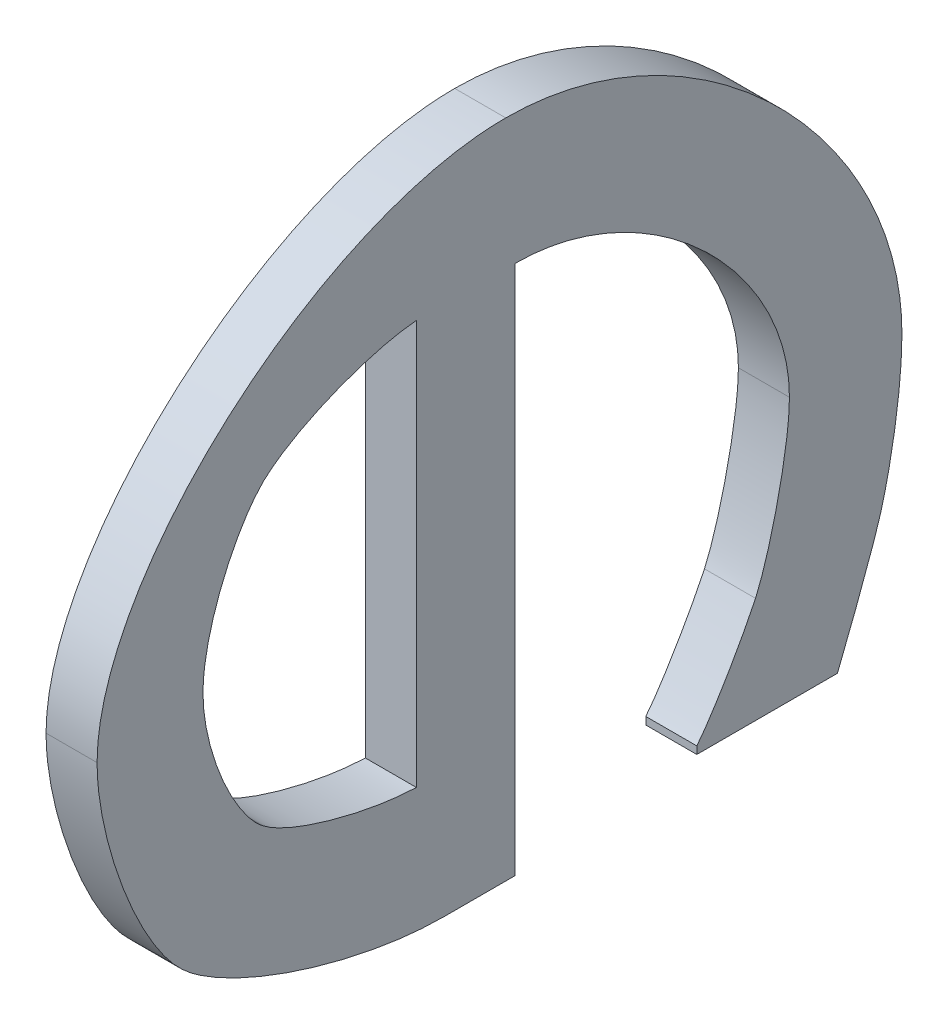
ISO-10303-21;
HEADER;
FILE_DESCRIPTION(('STEP AP214'),'2;1');
FILE_NAME('part.step','',(''),(''),'','','');
FILE_SCHEMA(('AUTOMOTIVE_DESIGN { 1 0 10303 214 1 1 1 1 }'));
ENDSEC;
DATA;
#1=APPLICATION_CONTEXT('core data for automotive mechanical design processes');
#2=APPLICATION_PROTOCOL_DEFINITION('international standard','automotive_design',2000,#1);
#3=PRODUCT_CONTEXT('',#1,'mechanical');
#4=PRODUCT('Part','Part','',(#3));
#5=PRODUCT_RELATED_PRODUCT_CATEGORY('part','',(#4));
#6=PRODUCT_DEFINITION_FORMATION('','',#4);
#7=PRODUCT_DEFINITION_CONTEXT('part definition',#1,'design');
#8=PRODUCT_DEFINITION('design','',#6,#7);
#9=PRODUCT_DEFINITION_SHAPE('','',#8);
#10=(LENGTH_UNIT() NAMED_UNIT(*) SI_UNIT(.MILLI.,.METRE.));
#11=(NAMED_UNIT(*) PLANE_ANGLE_UNIT() SI_UNIT($,.RADIAN.));
#12=(NAMED_UNIT(*) SI_UNIT($,.STERADIAN.) SOLID_ANGLE_UNIT());
#13=UNCERTAINTY_MEASURE_WITH_UNIT(LENGTH_MEASURE(1.E-05),#10,'distance_accuracy_value','');
#14=(GEOMETRIC_REPRESENTATION_CONTEXT(3) GLOBAL_UNCERTAINTY_ASSIGNED_CONTEXT((#13)) GLOBAL_UNIT_ASSIGNED_CONTEXT((#10,
#11,#12)) REPRESENTATION_CONTEXT('',''));
#15=CARTESIAN_POINT('',(0.,0.,0.));
#16=DIRECTION('',(0.,0.,1.));
#17=DIRECTION('',(1.,0.,0.));
#18=AXIS2_PLACEMENT_3D('',#15,#16,#17);
#19=CARTESIAN_POINT('',(-14.1348633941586,1.58473913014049,0.));
#20=DIRECTION('',(1.,0.,0.));
#21=DIRECTION('',(0.,0.,-1.));
#22=AXIS2_PLACEMENT_3D('',#19,#20,#21);
#23=PLANE('',#22);
#24=CARTESIAN_POINT('',(-14.1348633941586,-1.02459268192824,-5.47597118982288));
#25=CARTESIAN_POINT('',(-14.1348633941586,-1.02516922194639,-5.46924478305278));
#26=CARTESIAN_POINT('',(-14.1348633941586,-1.02595800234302,-5.46254149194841));
#27=CARTESIAN_POINT('',(-14.1348633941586,-1.02788502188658,-5.44919000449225));
#28=CARTESIAN_POINT('',(-14.1348633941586,-1.02902298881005,-5.44254176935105));
#29=CARTESIAN_POINT('',(-14.1348633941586,-1.03284614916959,-5.42269850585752));
#30=CARTESIAN_POINT('',(-14.1348633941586,-1.03594292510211,-5.40958336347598));
#31=CARTESIAN_POINT('',(-14.1348633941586,-1.04297613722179,-5.38351407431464));
#32=CARTESIAN_POINT('',(-14.1348633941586,-1.04691680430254,-5.37056110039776));
#33=CARTESIAN_POINT('',(-14.1348633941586,-1.05551289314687,-5.34488928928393));
#34=CARTESIAN_POINT('',(-14.1348633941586,-1.06016859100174,-5.33217054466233));
#35=CARTESIAN_POINT('',(-14.1348633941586,-1.07022032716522,-5.30685630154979));
#36=CARTESIAN_POINT('',(-14.1348633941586,-1.07562441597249,-5.29426400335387));
#37=CARTESIAN_POINT('',(-14.1348633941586,-1.08716183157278,-5.26944716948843));
#38=CARTESIAN_POINT('',(-14.1348633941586,-1.09329351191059,-5.25722187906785));
#39=CARTESIAN_POINT('',(-14.1348633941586,-1.10324163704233,-5.23909326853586));
#40=CARTESIAN_POINT('',(-14.1348633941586,-1.10673141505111,-5.23301052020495));
#41=CARTESIAN_POINT('',(-14.1348633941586,-1.11398338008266,-5.22101447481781));
#42=CARTESIAN_POINT('',(-14.1348633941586,-1.11774538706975,-5.21510106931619));
#43=CARTESIAN_POINT('',(-14.1348633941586,-1.12561219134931,-5.20347075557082));
#44=CARTESIAN_POINT('',(-14.1348633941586,-1.12971817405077,-5.19775463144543));
#45=CARTESIAN_POINT('',(-14.1348633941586,-1.13837986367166,-5.1866568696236));
#46=CARTESIAN_POINT('',(-14.1348633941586,-1.14293652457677,-5.18127598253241));
#47=CARTESIAN_POINT('',(-14.1348633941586,-1.14776934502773,-5.17613325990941));
#48=B_SPLINE_CURVE_WITH_KNOTS('',3,(#24,#25,#26,#27,#28,#29,#30,#31,#32,#33,#34,#35,#36,#37,#38,
#39,#40,#41,#42,#43,#44,#45,#46,#47),.UNSPECIFIED.,.F.,.F.,(4,2,2,2,2,2,2,2,2,2,2,4),(0.,
0.0202424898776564,0.0404692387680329,0.080857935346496,0.12145407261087,0.162065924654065,
0.203154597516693,0.244152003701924,0.265184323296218,0.286202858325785,0.307297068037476,
0.328436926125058),.UNSPECIFIED.);
#49=CARTESIAN_POINT('',(-14.1348633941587,-1.02459268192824,-5.47597118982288));
#50=VERTEX_POINT('',#49);
#51=CARTESIAN_POINT('',(-14.1348633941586,-1.14776934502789,-5.17613325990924));
#52=VERTEX_POINT('',#51);
#53=EDGE_CURVE('E393',#50,#52,#48,.T.);
#54=ORIENTED_EDGE('',*,*,#53,.T.);
#55=CARTESIAN_POINT('',(-14.1348633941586,-1.14776934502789,-5.17613325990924));
#56=CARTESIAN_POINT('',(-14.1348633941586,-1.15301928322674,-5.17091907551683));
#57=CARTESIAN_POINT('',(-14.1348633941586,-1.15854244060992,-5.16600539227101));
#58=CARTESIAN_POINT('',(-14.1348633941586,-1.1699773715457,-5.15667870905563));
#59=CARTESIAN_POINT('',(-14.1348633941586,-1.17588817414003,-5.15226452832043));
#60=CARTESIAN_POINT('',(-14.1348633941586,-1.18795175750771,-5.14382331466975));
#61=CARTESIAN_POINT('',(-14.1348633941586,-1.19410387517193,-5.13979531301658));
#62=CARTESIAN_POINT('',(-14.1348633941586,-1.20661055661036,-5.13205710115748));
#63=CARTESIAN_POINT('',(-14.1348633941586,-1.21296527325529,-5.12834713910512));
#64=CARTESIAN_POINT('',(-14.1348633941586,-1.23338773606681,-5.11701347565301));
#65=CARTESIAN_POINT('',(-14.1348633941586,-1.24774661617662,-5.10991199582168));
#66=CARTESIAN_POINT('',(-14.1348633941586,-1.27700608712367,-5.09686279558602));
#67=CARTESIAN_POINT('',(-14.1348633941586,-1.29190766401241,-5.0909173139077));
#68=CARTESIAN_POINT('',(-14.1348633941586,-1.31834544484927,-5.08157005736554));
#69=CARTESIAN_POINT('',(-14.1348633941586,-1.32978836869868,-5.07790429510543));
#70=CARTESIAN_POINT('',(-14.1348633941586,-1.35288178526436,-5.07133111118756));
#71=CARTESIAN_POINT('',(-14.1348633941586,-1.36453211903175,-5.0684231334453));
#72=CARTESIAN_POINT('',(-14.1348633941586,-1.38799517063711,-5.06350591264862));
#73=CARTESIAN_POINT('',(-14.1348633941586,-1.39980730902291,-5.06149404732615));
#74=CARTESIAN_POINT('',(-14.1348633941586,-1.4236018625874,-5.05867037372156));
#75=CARTESIAN_POINT('',(-14.1348633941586,-1.43558465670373,-5.05786188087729));
#76=CARTESIAN_POINT('',(-14.1348633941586,-1.44760727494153,-5.05781883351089));
#77=B_SPLINE_CURVE_WITH_KNOTS('',3,(#55,#56,#57,#58,#59,#60,#61,#62,#63,#64,#65,#66,#67,#68,#69,
#70,#71,#72,#73,#74,#75,#76),.UNSPECIFIED.,.F.,.F.,(4,2,2,2,2,2,2,2,2,2,4),(0.,
0.0221610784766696,0.0442686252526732,0.0663191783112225,0.0883867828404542,0.136378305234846,
0.184461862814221,0.220486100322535,0.256483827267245,0.292375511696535,0.328365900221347),.UNSPECIFIED.);
#78=CARTESIAN_POINT('',(-14.1348633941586,-1.44760727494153,-5.05781883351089));
#79=VERTEX_POINT('',#78);
#80=EDGE_CURVE('E388',#52,#79,#77,.T.);
#81=ORIENTED_EDGE('',*,*,#80,.T.);
#82=CARTESIAN_POINT('',(-14.1348633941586,-1.44760727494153,-5.05781883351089));
#83=CARTESIAN_POINT('',(-14.1348633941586,-1.45813345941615,-5.05784236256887));
#84=CARTESIAN_POINT('',(-14.1348633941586,-1.46863585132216,-5.05845311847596));
#85=CARTESIAN_POINT('',(-14.1348633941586,-1.48952105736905,-5.06063497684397));
#86=CARTESIAN_POINT('',(-14.1348633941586,-1.49990407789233,-5.06220403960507));
#87=CARTESIAN_POINT('',(-14.1348633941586,-1.52073174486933,-5.06612952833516));
#88=CARTESIAN_POINT('',(-14.1348633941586,-1.5311734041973,-5.06850120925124));
#89=CARTESIAN_POINT('',(-14.1348633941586,-1.55188322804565,-5.07392128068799));
#90=CARTESIAN_POINT('',(-14.1348633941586,-1.56215127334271,-5.07697011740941));
#91=CARTESIAN_POINT('',(-14.1348633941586,-1.59355048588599,-5.0873185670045));
#92=CARTESIAN_POINT('',(-14.1348633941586,-1.61436249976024,-5.09563740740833));
#93=CARTESIAN_POINT('',(-14.1348633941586,-1.64449046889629,-5.11009704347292));
#94=CARTESIAN_POINT('',(-14.1348633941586,-1.65430708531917,-5.11521802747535));
#95=CARTESIAN_POINT('',(-14.1348633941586,-1.67349413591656,-5.1262394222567));
#96=CARTESIAN_POINT('',(-14.1348633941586,-1.68286485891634,-5.13213931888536));
#97=CARTESIAN_POINT('',(-14.1348633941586,-1.69913427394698,-5.14368704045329));
#98=CARTESIAN_POINT('',(-14.1348633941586,-1.70615661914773,-5.14915611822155));
#99=CARTESIAN_POINT('',(-14.1348633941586,-1.71612178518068,-5.15804270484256));
#100=CARTESIAN_POINT('',(-14.1348633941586,-1.71935662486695,-5.16112785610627));
#101=CARTESIAN_POINT('',(-14.1348633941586,-1.725540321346,-5.16758908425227));
#102=CARTESIAN_POINT('',(-14.1348633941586,-1.72848824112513,-5.17096605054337));
#103=CARTESIAN_POINT('',(-14.1348633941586,-1.73123774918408,-5.17451251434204));
#104=B_SPLINE_CURVE_WITH_KNOTS('',3,(#82,#83,#84,#85,#86,#87,#88,#89,#90,#91,#92,#93,#94,#95,
#96,#97,#98,#99,#100,#101,#102,#103),.UNSPECIFIED.,.F.,.F.,(4,2,2,2,2,2,2,2,2,2,4),(0.,
0.0315295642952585,0.0629922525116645,0.0950900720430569,0.127209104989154,0.194227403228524,
0.227420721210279,0.260592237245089,0.287237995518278,0.300632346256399,0.314069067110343),.UNSPECIFIED.);
#105=CARTESIAN_POINT('',(-14.1348633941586,-1.73123774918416,-5.17451251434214));
#106=VERTEX_POINT('',#105);
#107=EDGE_CURVE('E379',#79,#106,#104,.T.);
#108=ORIENTED_EDGE('',*,*,#107,.T.);
#109=CARTESIAN_POINT('',(-14.1348633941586,-1.73123774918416,-5.17451251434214));
#110=CARTESIAN_POINT('',(-14.1348633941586,-1.7348417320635,-5.17905420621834));
#111=CARTESIAN_POINT('',(-14.1348633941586,-1.73812714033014,-5.1838165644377));
#112=CARTESIAN_POINT('',(-14.1348633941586,-1.74421986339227,-5.19361961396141));
#113=CARTESIAN_POINT('',(-14.1348633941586,-1.74702875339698,-5.19865931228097));
#114=CARTESIAN_POINT('',(-14.1348633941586,-1.75233791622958,-5.20886434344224));
#115=CARTESIAN_POINT('',(-14.1348633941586,-1.75483948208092,-5.21402903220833));
#116=CARTESIAN_POINT('',(-14.1348633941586,-1.75961306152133,-5.22447025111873));
#117=CARTESIAN_POINT('',(-14.1348633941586,-1.7618848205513,-5.22974689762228));
#118=CARTESIAN_POINT('',(-14.1348633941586,-1.77178493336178,-5.25384256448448));
#119=CARTESIAN_POINT('',(-14.1348633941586,-1.7783917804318,-5.27307906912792));
#120=CARTESIAN_POINT('',(-14.1348633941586,-1.79018316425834,-5.31206444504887));
#121=CARTESIAN_POINT('',(-14.1348633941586,-1.79536057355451,-5.33181536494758));
#122=CARTESIAN_POINT('',(-14.1348633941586,-1.80215370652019,-5.36198325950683));
#123=CARTESIAN_POINT('',(-14.1348633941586,-1.80427964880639,-5.37228571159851));
#124=CARTESIAN_POINT('',(-14.1348633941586,-1.80813327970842,-5.39296224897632));
#125=CARTESIAN_POINT('',(-14.1348633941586,-1.80986107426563,-5.40333631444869));
#126=CARTESIAN_POINT('',(-14.1348633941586,-1.81285293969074,-5.42405396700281));
#127=CARTESIAN_POINT('',(-14.1348633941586,-1.81412121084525,-5.43439692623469));
#128=CARTESIAN_POINT('',(-14.1348633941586,-1.81608889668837,-5.45514365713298));
#129=CARTESIAN_POINT('',(-14.1348633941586,-1.81678787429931,-5.46554746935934));
#130=CARTESIAN_POINT('',(-14.1348633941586,-1.8171372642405,-5.47597118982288));
#131=B_SPLINE_CURVE_WITH_KNOTS('',3,(#109,#110,#111,#112,#113,#114,#115,#116,#117,#118,#119,
#120,#121,#122,#123,#124,#125,#126,#127,#128,#129,#130),.UNSPECIFIED.,.F.,.F.,(4,2,2,2,2,2,2,2,
2,2,4),(0.,0.0173451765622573,0.0346318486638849,0.0518430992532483,0.069073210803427,
0.129986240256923,0.191197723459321,0.222749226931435,0.254292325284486,0.285539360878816,
0.316810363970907),.UNSPECIFIED.);
#132=CARTESIAN_POINT('',(-14.1348633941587,-1.8171372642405,-5.47597118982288));
#133=VERTEX_POINT('',#132);
#134=EDGE_CURVE('E165',#106,#133,#131,.T.);
#135=ORIENTED_EDGE('',*,*,#134,.T.);
#136=DIRECTION('',(0.,1.,0.));
#137=VECTOR('',#136,1.);
#138=CARTESIAN_POINT('',(-14.1348633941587,-1.02459268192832,-5.47597118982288));
#139=LINE('',#138,#137);
#140=EDGE_CURVE('E349',#133,#50,#139,.T.);
#141=ORIENTED_EDGE('',*,*,#140,.T.);
#142=EDGE_LOOP('',(#54,#81,#108,#135,#141));
#143=FACE_BOUND('',#142,.T.);
#144=DIRECTION('',(0.,1.,0.));
#145=VECTOR('',#144,1.);
#146=CARTESIAN_POINT('',(-14.1348633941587,-1.02459268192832,-5.66883991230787));
#147=LINE('',#146,#145);
#148=CARTESIAN_POINT('',(-14.1348633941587,-1.02459268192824,-5.66883991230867));
#149=VERTEX_POINT('',#148);
#150=CARTESIAN_POINT('',(-14.1348633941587,-2.06349059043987,-5.66883991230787));
#151=VERTEX_POINT('',#150);
#152=EDGE_CURVE('E358',#149,#151,#147,.F.);
#153=ORIENTED_EDGE('',*,*,#152,.T.);
#154=DIRECTION('',(0.,0.,1.));
#155=VECTOR('',#154,1.);
#156=CARTESIAN_POINT('',(-14.1348633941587,-2.0634905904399,-5.66883991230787));
#157=LINE('',#156,#155);
#158=CARTESIAN_POINT('',(-14.1348633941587,-2.06349059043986,-5.53107653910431));
#159=VERTEX_POINT('',#158);
#160=EDGE_CURVE('E352',#151,#159,#157,.T.);
#161=ORIENTED_EDGE('',*,*,#160,.T.);
#162=CARTESIAN_POINT('',(-14.1348633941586,-2.06349059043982,-5.53107653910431));
#163=CARTESIAN_POINT('',(-14.1348633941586,-2.06346432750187,-5.51423560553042));
#164=CARTESIAN_POINT('',(-14.1348633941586,-2.06274084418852,-5.49741476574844));
#165=CARTESIAN_POINT('',(-14.1348633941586,-2.06014072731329,-5.46388118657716));
#166=CARTESIAN_POINT('',(-14.1348633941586,-2.0582655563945,-5.44716833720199));
#167=CARTESIAN_POINT('',(-14.1348633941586,-2.05359178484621,-5.41380228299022));
#168=CARTESIAN_POINT('',(-14.1348633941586,-2.05078914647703,-5.39714966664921));
#169=CARTESIAN_POINT('',(-14.1348633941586,-2.04437930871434,-5.36399487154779));
#170=CARTESIAN_POINT('',(-14.1348633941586,-2.04077177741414,-5.34749275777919));
#171=CARTESIAN_POINT('',(-14.1348633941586,-2.03014766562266,-5.30357104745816));
#172=CARTESIAN_POINT('',(-14.1348633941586,-2.02247440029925,-5.276306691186));
#173=CARTESIAN_POINT('',(-14.1348633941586,-2.00949868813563,-5.23592815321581));
#174=CARTESIAN_POINT('',(-14.1348633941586,-2.00493557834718,-5.22257088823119));
#175=CARTESIAN_POINT('',(-14.1348633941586,-1.99528698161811,-5.1960353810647));
#176=CARTESIAN_POINT('',(-14.1348633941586,-1.99020118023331,-5.18285725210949));
#177=CARTESIAN_POINT('',(-14.1348633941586,-1.97923339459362,-5.15618834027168));
#178=CARTESIAN_POINT('',(-14.1348633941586,-1.97332698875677,-5.14270757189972));
#179=CARTESIAN_POINT('',(-14.1348633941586,-1.96079271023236,-5.11610293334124));
#180=CARTESIAN_POINT('',(-14.1348633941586,-1.95416587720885,-5.10297858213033));
#181=CARTESIAN_POINT('',(-14.1348633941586,-1.94350464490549,-5.08364477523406));
#182=CARTESIAN_POINT('',(-14.1348633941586,-1.93982007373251,-5.0772425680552));
#183=CARTESIAN_POINT('',(-14.1348633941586,-1.9321692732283,-5.06461356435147));
#184=CARTESIAN_POINT('',(-14.1348633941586,-1.92820322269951,-5.05838665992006));
#185=CARTESIAN_POINT('',(-14.1348633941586,-1.91990808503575,-5.04613254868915));
#186=CARTESIAN_POINT('',(-14.1348633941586,-1.91557741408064,-5.04010639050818));
#187=CARTESIAN_POINT('',(-14.1348633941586,-1.90644581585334,-5.02840356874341));
#188=CARTESIAN_POINT('',(-14.1348633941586,-1.90164389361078,-5.02272768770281));
#189=CARTESIAN_POINT('',(-14.1348633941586,-1.89655379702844,-5.01730019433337));
#190=B_SPLINE_CURVE_WITH_KNOTS('',3,(#162,#163,#164,#165,#166,#167,#168,#169,#170,#171,#172,
#173,#174,#175,#176,#177,#178,#179,#180,#181,#182,#183,#184,#185,#186,#187,#188,#189),
.UNSPECIFIED.,.F.,.F.,(4,2,2,2,2,2,2,2,2,2,2,2,2,4),(0.,0.0504808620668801,0.100897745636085,
0.151537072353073,0.202197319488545,0.287078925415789,0.329416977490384,0.371780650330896,
0.415918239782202,0.459992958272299,0.482147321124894,0.504287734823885,0.526529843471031,
0.548819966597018),.UNSPECIFIED.);
#191=CARTESIAN_POINT('',(-14.1348633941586,-1.89655379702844,-5.01730019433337));
#192=VERTEX_POINT('',#191);
#193=EDGE_CURVE('E409',#159,#192,#190,.T.);
#194=ORIENTED_EDGE('',*,*,#193,.T.);
#195=CARTESIAN_POINT('',(-14.1348633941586,-1.89655379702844,-5.01730019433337));
#196=CARTESIAN_POINT('',(-14.1348633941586,-1.89008051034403,-5.01035205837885));
#197=CARTESIAN_POINT('',(-14.1348633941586,-1.88318870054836,-5.00383727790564));
#198=CARTESIAN_POINT('',(-14.1348633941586,-1.86882450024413,-4.99152983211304));
#199=CARTESIAN_POINT('',(-14.1348633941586,-1.86135424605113,-4.98573469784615));
#200=CARTESIAN_POINT('',(-14.1348633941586,-1.84605277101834,-4.97468398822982));
#201=CARTESIAN_POINT('',(-14.1348633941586,-1.83822214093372,-4.96942757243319));
#202=CARTESIAN_POINT('',(-14.1348633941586,-1.82227439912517,-4.95934891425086));
#203=CARTESIAN_POINT('',(-14.1348633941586,-1.81415695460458,-4.95452720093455));
#204=CARTESIAN_POINT('',(-14.1348633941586,-1.78828653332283,-4.93994043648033));
#205=CARTESIAN_POINT('',(-14.1348633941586,-1.77015555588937,-4.93084517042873));
#206=CARTESIAN_POINT('',(-14.1348633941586,-1.73327125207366,-4.91403059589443));
#207=CARTESIAN_POINT('',(-14.1348633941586,-1.7145176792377,-4.90631184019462));
#208=CARTESIAN_POINT('',(-14.1348633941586,-1.67646343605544,-4.89212079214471));
#209=CARTESIAN_POINT('',(-14.1348633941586,-1.657160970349,-4.88565330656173));
#210=CARTESIAN_POINT('',(-14.1348633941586,-1.61816066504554,-4.8740512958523));
#211=CARTESIAN_POINT('',(-14.1348633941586,-1.59846286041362,-4.86891665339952));
#212=CARTESIAN_POINT('',(-14.1348633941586,-1.55940075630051,-4.86035830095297));
#213=CARTESIAN_POINT('',(-14.1348633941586,-1.5400485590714,-4.85688146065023));
#214=CARTESIAN_POINT('',(-14.1348633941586,-1.51089535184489,-4.85314337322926));
#215=CARTESIAN_POINT('',(-14.1348633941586,-1.50119033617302,-4.85214446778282));
#216=CARTESIAN_POINT('',(-14.1348633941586,-1.48172521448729,-4.85075976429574));
#217=CARTESIAN_POINT('',(-14.1348633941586,-1.47196505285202,-4.85037477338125));
#218=CARTESIAN_POINT('',(-14.1348633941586,-1.46219398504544,-4.85036340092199));
#219=B_SPLINE_CURVE_WITH_KNOTS('',3,(#195,#196,#197,#198,#199,#200,#201,#202,#203,#204,#205,
#206,#207,#208,#209,#210,#211,#212,#213,#214,#215,#216,#217,#218),.UNSPECIFIED.,.F.,.F.,(4,2,2,
2,2,2,2,2,2,2,2,4),(0.,0.0284244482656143,0.0567485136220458,0.0850276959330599,
0.113340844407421,0.174112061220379,0.234907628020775,0.295932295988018,0.356951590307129,
0.415856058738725,0.4451080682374,0.474398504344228),.UNSPECIFIED.);
#220=CARTESIAN_POINT('',(-14.1348633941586,-1.46219398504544,-4.85036340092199));
#221=VERTEX_POINT('',#220);
#222=EDGE_CURVE('E405',#192,#221,#219,.T.);
#223=ORIENTED_EDGE('',*,*,#222,.T.);
#224=CARTESIAN_POINT('',(-14.1348633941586,-1.46219398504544,-4.85036340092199));
#225=CARTESIAN_POINT('',(-14.1348633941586,-1.45385029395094,-4.85036325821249));
#226=CARTESIAN_POINT('',(-14.1348633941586,-1.44551130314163,-4.85067899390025));
#227=CARTESIAN_POINT('',(-14.1348633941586,-1.43303753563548,-4.85159036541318));
#228=CARTESIAN_POINT('',(-14.1348633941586,-1.42888649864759,-4.85196695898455));
#229=CARTESIAN_POINT('',(-14.1348633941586,-1.4205995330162,-4.85285999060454));
#230=CARTESIAN_POINT('',(-14.1348633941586,-1.41646360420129,-4.85337642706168));
#231=CARTESIAN_POINT('',(-14.1348633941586,-1.40821094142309,-4.85454303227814));
#232=CARTESIAN_POINT('',(-14.1348633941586,-1.40409420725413,-4.85519319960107));
#233=CARTESIAN_POINT('',(-14.1348633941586,-1.39177373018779,-4.8573360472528));
#234=CARTESIAN_POINT('',(-14.1348633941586,-1.38360246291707,-4.85902076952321));
#235=CARTESIAN_POINT('',(-14.1348633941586,-1.37143208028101,-4.86189593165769));
#236=CARTESIAN_POINT('',(-14.1348633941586,-1.36739042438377,-4.86291211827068));
#237=CARTESIAN_POINT('',(-14.1348633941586,-1.35933641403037,-4.86505530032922));
#238=CARTESIAN_POINT('',(-14.1348633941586,-1.35532405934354,-4.86618229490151));
#239=CARTESIAN_POINT('',(-14.1348633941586,-1.34733073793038,-4.86854175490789));
#240=CARTESIAN_POINT('',(-14.1348633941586,-1.34334977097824,-4.86977421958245));
#241=CARTESIAN_POINT('',(-14.1348633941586,-1.33145332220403,-4.87362316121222));
#242=CARTESIAN_POINT('',(-14.1348633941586,-1.32358606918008,-4.87639070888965));
#243=CARTESIAN_POINT('',(-14.1348633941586,-1.31189141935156,-4.88081515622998));
#244=CARTESIAN_POINT('',(-14.1348633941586,-1.3080113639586,-4.88233529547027));
#245=CARTESIAN_POINT('',(-14.1348633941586,-1.3002865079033,-4.88546269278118));
#246=CARTESIAN_POINT('',(-14.1348633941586,-1.29644170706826,-4.88706995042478));
#247=CARTESIAN_POINT('',(-14.1348633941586,-1.28495939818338,-4.89201710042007));
#248=CARTESIAN_POINT('',(-14.1348633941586,-1.27737525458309,-4.89548188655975));
#249=CARTESIAN_POINT('',(-14.1348633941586,-1.26611043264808,-4.90090594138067));
#250=CARTESIAN_POINT('',(-14.1348633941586,-1.26237437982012,-4.9027516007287));
#251=CARTESIAN_POINT('',(-14.1348633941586,-1.25493903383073,-4.90651554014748));
#252=CARTESIAN_POINT('',(-14.1348633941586,-1.25123974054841,-4.90843381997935));
#253=CARTESIAN_POINT('',(-14.1348633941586,-1.24019596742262,-4.91429358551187));
#254=CARTESIAN_POINT('',(-14.1348633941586,-1.23290652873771,-4.91833954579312));
#255=CARTESIAN_POINT('',(-14.1348633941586,-1.22208474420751,-4.92459956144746));
#256=CARTESIAN_POINT('',(-14.1348633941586,-1.21849644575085,-4.92671793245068));
#257=CARTESIAN_POINT('',(-14.1348633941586,-1.20778594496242,-4.93316581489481));
#258=CARTESIAN_POINT('',(-14.1348633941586,-1.20071889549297,-4.93758767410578));
#259=CARTESIAN_POINT('',(-14.1348633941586,-1.19023000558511,-4.94439032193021));
#260=CARTESIAN_POINT('',(-14.1348633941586,-1.18675251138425,-4.94668604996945));
#261=CARTESIAN_POINT('',(-14.1348633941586,-1.17983431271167,-4.95133229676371));
#262=CARTESIAN_POINT('',(-14.1348633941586,-1.17639360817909,-4.95368281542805));
#263=CARTESIAN_POINT('',(-14.1348633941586,-1.1661257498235,-4.96081416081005));
#264=CARTESIAN_POINT('',(-14.1348633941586,-1.15935344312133,-4.96567439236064));
#265=CARTESIAN_POINT('',(-14.1348633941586,-1.14930536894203,-4.97311206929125));
#266=CARTESIAN_POINT('',(-14.1348633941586,-1.14597455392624,-4.97561573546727));
#267=CARTESIAN_POINT('',(-14.1348633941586,-1.13603599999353,-4.98319886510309));
#268=CARTESIAN_POINT('',(-14.1348633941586,-1.12948265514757,-4.98835009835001));
#269=CARTESIAN_POINT('',(-14.1348633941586,-1.11976214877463,-4.99621081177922));
#270=CARTESIAN_POINT('',(-14.1348633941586,-1.11654035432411,-4.99885325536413));
#271=CARTESIAN_POINT('',(-14.1348633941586,-1.10692860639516,-5.00684636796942));
#272=CARTESIAN_POINT('',(-14.1348633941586,-1.10059272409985,-5.01226247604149));
#273=CARTESIAN_POINT('',(-14.1348633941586,-1.09119782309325,-5.02050940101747));
#274=CARTESIAN_POINT('',(-14.1348633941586,-1.08808444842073,-5.02327873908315));
#275=CARTESIAN_POINT('',(-14.1348633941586,-1.07879785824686,-5.03164728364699));
#276=CARTESIAN_POINT('',(-14.1348633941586,-1.07267856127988,-5.03730669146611));
#277=CARTESIAN_POINT('',(-14.1348633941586,-1.0636084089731,-5.04590936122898));
#278=CARTESIAN_POINT('',(-14.1348633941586,-1.06060324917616,-5.0487957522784));
#279=CARTESIAN_POINT('',(-14.1348633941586,-1.05164142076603,-5.05751110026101));
#280=CARTESIAN_POINT('',(-14.1348633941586,-1.04573874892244,-5.0633959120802));
#281=CARTESIAN_POINT('',(-14.1348633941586,-1.03699395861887,-5.07232902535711));
#282=CARTESIAN_POINT('',(-14.1348633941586,-1.03409731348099,-5.07532429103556));
#283=CARTESIAN_POINT('',(-14.1348633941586,-1.02546141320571,-5.08436263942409));
#284=CARTESIAN_POINT('',(-14.1348633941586,-1.01977650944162,-5.09045795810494));
#285=CARTESIAN_POINT('',(-14.1348633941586,-1.01135941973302,-5.09970042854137));
#286=CARTESIAN_POINT('',(-14.1348633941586,-1.00857217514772,-5.10279774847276));
#287=CARTESIAN_POINT('',(-14.1348633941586,-1.00026516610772,-5.11213923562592));
#288=CARTESIAN_POINT('',(-14.1348633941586,-0.994800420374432,-5.11843261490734));
#289=CARTESIAN_POINT('',(-14.1348633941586,-0.98671530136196,-5.12796680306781));
#290=CARTESIAN_POINT('',(-14.1348633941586,-0.984038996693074,-5.1311604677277));
#291=CARTESIAN_POINT('',(-14.1348633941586,-0.976065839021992,-5.14078845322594));
#292=CARTESIAN_POINT('',(-14.1348633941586,-0.970825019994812,-5.14726944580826));
#293=CARTESIAN_POINT('',(-14.1348633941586,-0.963078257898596,-5.15708053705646));
#294=CARTESIAN_POINT('',(-14.1348633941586,-0.960515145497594,-5.16036574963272));
#295=CARTESIAN_POINT('',(-14.1348633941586,-0.952883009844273,-5.17026619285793));
#296=CARTESIAN_POINT('',(-14.1348633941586,-0.947871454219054,-5.17692589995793));
#297=CARTESIAN_POINT('',(-14.1348633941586,-0.938004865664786,-5.19036028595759));
#298=CARTESIAN_POINT('',(-14.1348633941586,-0.933149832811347,-5.19713496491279));
#299=CARTESIAN_POINT('',(-14.1348633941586,-0.925987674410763,-5.20738054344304));
#300=CARTESIAN_POINT('',(-14.1348633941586,-0.923620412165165,-5.21080957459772));
#301=CARTESIAN_POINT('',(-14.1348633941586,-0.916579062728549,-5.22113865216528));
#302=CARTESIAN_POINT('',(-14.1348633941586,-0.911965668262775,-5.22808032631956));
#303=CARTESIAN_POINT('',(-14.1348633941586,-0.905170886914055,-5.23857322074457));
#304=CARTESIAN_POINT('',(-14.1348633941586,-0.902926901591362,-5.24208415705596));
#305=CARTESIAN_POINT('',(-14.1348633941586,-0.896257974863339,-5.25265753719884));
#306=CARTESIAN_POINT('',(-14.1348633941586,-0.891896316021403,-5.25976017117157));
#307=CARTESIAN_POINT('',(-14.1348633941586,-0.885485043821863,-5.2704917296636));
#308=CARTESIAN_POINT('',(-14.1348633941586,-0.883369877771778,-5.27408175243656));
#309=CARTESIAN_POINT('',(-14.1348633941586,-0.877090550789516,-5.28489111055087));
#310=CARTESIAN_POINT('',(-14.1348633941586,-0.87299281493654,-5.29214932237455));
#311=CARTESIAN_POINT('',(-14.1348633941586,-0.866984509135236,-5.30311163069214));
#312=CARTESIAN_POINT('',(-14.1348633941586,-0.865004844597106,-5.30677812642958));
#313=CARTESIAN_POINT('',(-14.1348633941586,-0.859135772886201,-5.31781569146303));
#314=CARTESIAN_POINT('',(-14.1348633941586,-0.855316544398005,-5.32522438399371));
#315=CARTESIAN_POINT('',(-14.1348633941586,-0.849734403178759,-5.33640978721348));
#316=CARTESIAN_POINT('',(-14.1348633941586,-0.847898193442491,-5.3401502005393));
#317=CARTESIAN_POINT('',(-14.1348633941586,-0.842463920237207,-5.35140829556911));
#318=CARTESIAN_POINT('',(-14.1348633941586,-0.838940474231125,-5.35896232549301));
#319=CARTESIAN_POINT('',(-14.1348633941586,-0.833811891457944,-5.37036290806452));
#320=CARTESIAN_POINT('',(-14.1348633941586,-0.832128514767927,-5.37417456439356));
#321=CARTESIAN_POINT('',(-14.1348633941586,-0.827157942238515,-5.38564505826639));
#322=CARTESIAN_POINT('',(-14.1348633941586,-0.823950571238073,-5.39333884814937));
#323=CARTESIAN_POINT('',(-14.1348633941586,-0.819307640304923,-5.40494580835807));
#324=CARTESIAN_POINT('',(-14.1348633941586,-0.817788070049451,-5.40882569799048));
#325=CARTESIAN_POINT('',(-14.1348633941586,-0.813314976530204,-5.42049933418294));
#326=CARTESIAN_POINT('',(-14.1348633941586,-0.810447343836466,-5.42832639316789));
#327=CARTESIAN_POINT('',(-14.1348633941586,-0.806327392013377,-5.44012926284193));
#328=CARTESIAN_POINT('',(-14.1348633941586,-0.80498437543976,-5.44407377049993));
#329=CARTESIAN_POINT('',(-14.1348633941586,-0.801047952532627,-5.45593932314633));
#330=CARTESIAN_POINT('',(-14.1348633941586,-0.798547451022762,-5.46389164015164));
#331=CARTESIAN_POINT('',(-14.1348633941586,-0.794993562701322,-5.47587729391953));
#332=CARTESIAN_POINT('',(-14.1348633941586,-0.793841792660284,-5.47988185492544));
#333=CARTESIAN_POINT('',(-14.1348633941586,-0.790487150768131,-5.49192505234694));
#334=CARTESIAN_POINT('',(-14.1348633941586,-0.788385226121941,-5.49999231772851));
#335=CARTESIAN_POINT('',(-14.1348633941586,-0.785446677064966,-5.51214371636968));
#336=CARTESIAN_POINT('',(-14.1348633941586,-0.784502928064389,-5.51620238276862));
#337=CARTESIAN_POINT('',(-14.1348633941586,-0.781781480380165,-5.52840451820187));
#338=CARTESIAN_POINT('',(-14.1348633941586,-0.780113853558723,-5.53657308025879));
#339=CARTESIAN_POINT('',(-14.1348633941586,-0.777846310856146,-5.54886778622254));
#340=CARTESIAN_POINT('',(-14.1348633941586,-0.777129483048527,-5.55297274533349));
#341=CARTESIAN_POINT('',(-14.1348633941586,-0.775776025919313,-5.56119585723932));
#342=CARTESIAN_POINT('',(-14.1348633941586,-0.775139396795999,-5.56531401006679));
#343=CARTESIAN_POINT('',(-14.1348633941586,-0.773353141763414,-5.57768826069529));
#344=CARTESIAN_POINT('',(-14.1348633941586,-0.772327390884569,-5.58596284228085));
#345=CARTESIAN_POINT('',(-14.1348633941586,-0.771051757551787,-5.59840000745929));
#346=CARTESIAN_POINT('',(-14.1348633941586,-0.77067039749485,-5.60254963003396));
#347=CARTESIAN_POINT('',(-14.1348633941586,-0.769737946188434,-5.61406575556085));
#348=CARTESIAN_POINT('',(-14.1348633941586,-0.769283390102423,-5.6214404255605));
#349=CARTESIAN_POINT('',(-14.1348633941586,-0.768671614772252,-5.63621387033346));
#350=CARTESIAN_POINT('',(-14.1348633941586,-0.768514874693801,-5.64361266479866));
#351=CARTESIAN_POINT('',(-14.1348633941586,-0.76851488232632,-5.65101171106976));
#352=B_SPLINE_CURVE_WITH_KNOTS('',3,(#224,#225,#226,#227,#228,#229,#230,#231,#232,#233,#234,
#235,#236,#237,#238,#239,#240,#241,#242,#243,#244,#245,#246,#247,#248,#249,#250,#251,#252,#253,
#254,#255,#256,#257,#258,#259,#260,#261,#262,#263,#264,#265,#266,#267,#268,#269,#270,#271,#272,
#273,#274,#275,#276,#277,#278,#279,#280,#281,#282,#283,#284,#285,#286,#287,#288,#289,#290,#291,
#292,#293,#294,#295,#296,#297,#298,#299,#300,#301,#302,#303,#304,#305,#306,#307,#308,#309,#310,
#311,#312,#313,#314,#315,#316,#317,#318,#319,#320,#321,#322,#323,#324,#325,#326,#327,#328,#329,
#330,#331,#332,#333,#334,#335,#336,#337,#338,#339,#340,#341,#342,#343,#344,#345,#346,#347,#348,
#349,#350,#351),.UNSPECIFIED.,.F.,.F.,(4,2,2,2,2,2,2,2,2,2,2,2,2,2,2,2,2,2,2,2,2,2,2,2,2,2,2,2,
2,2,2,2,2,2,2,2,2,2,2,2,2,2,2,2,2,2,2,2,2,2,2,2,2,2,2,2,2,2,2,2,2,2,2,4),(0.,0.0250170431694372,
0.0375189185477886,0.050020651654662,0.0625222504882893,0.0875337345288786,0.100034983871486,
0.112536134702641,0.125037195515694,0.150044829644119,0.162545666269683,0.175046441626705,
0.200052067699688,0.212552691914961,0.225053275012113,0.250057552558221,0.262558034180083,
0.287561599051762,0.300062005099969,0.312562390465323,0.337565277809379,0.350065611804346,
0.375068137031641,0.387568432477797,0.412570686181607,0.425070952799,0.450073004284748,
0.462573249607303,0.487575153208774,0.500075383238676,0.525077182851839,0.537577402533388,
0.562579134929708,0.57507934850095,0.60008104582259,0.612581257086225,0.637582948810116,
0.662584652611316,0.675084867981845,0.700086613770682,0.712586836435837,0.737588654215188,
0.750088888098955,0.775090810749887,0.787591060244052,0.812593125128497,0.825093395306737,
0.850095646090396,0.862595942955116,0.887598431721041,0.900098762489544,0.925101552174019,
0.937601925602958,0.96260509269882,0.975105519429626,1.00010915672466,1.01260964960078,
1.03761386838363,1.05011444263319,1.06261504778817,1.08762024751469,1.10012095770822,
1.12228065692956,1.1444759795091),.UNSPECIFIED.);
#353=CARTESIAN_POINT('',(-14.1348633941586,-0.76851488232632,-5.65101171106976));
#354=VERTEX_POINT('',#353);
#355=EDGE_CURVE('E401',#221,#354,#352,.T.);
#356=ORIENTED_EDGE('',*,*,#355,.T.);
#357=CARTESIAN_POINT('',(-14.1348633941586,-0.76851488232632,-5.65101171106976));
#358=CARTESIAN_POINT('',(-14.1348633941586,-0.768522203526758,-5.68312119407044));
#359=CARTESIAN_POINT('',(-14.1348633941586,-0.771445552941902,-5.71507937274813));
#360=CARTESIAN_POINT('',(-14.1348633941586,-0.782212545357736,-5.77794425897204));
#361=CARTESIAN_POINT('',(-14.1348633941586,-0.7900213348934,-5.80885679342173));
#362=CARTESIAN_POINT('',(-14.1348633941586,-0.813827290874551,-5.88213970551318));
#363=CARTESIAN_POINT('',(-14.1348633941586,-0.83189072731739,-5.92382740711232));
#364=CARTESIAN_POINT('',(-14.1348633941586,-0.874397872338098,-6.00395392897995));
#365=CARTESIAN_POINT('',(-14.1348633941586,-0.898868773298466,-6.04237795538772));
#366=CARTESIAN_POINT('',(-14.1348633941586,-0.953890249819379,-6.11659754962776));
#367=CARTESIAN_POINT('',(-14.1348633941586,-0.984617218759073,-6.15226172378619));
#368=CARTESIAN_POINT('',(-14.1348633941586,-1.05081948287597,-6.21887557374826));
#369=CARTESIAN_POINT('',(-14.1348633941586,-1.08629415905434,-6.24982586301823));
#370=CARTESIAN_POINT('',(-14.1348633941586,-1.15753577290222,-6.30305107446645));
#371=CARTESIAN_POINT('',(-14.1348633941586,-1.19287397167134,-6.32589760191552));
#372=CARTESIAN_POINT('',(-14.1348633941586,-1.26654745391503,-6.36580520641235));
#373=CARTESIAN_POINT('',(-14.1348633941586,-1.30486818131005,-6.38289244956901));
#374=CARTESIAN_POINT('',(-14.1348633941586,-1.37321936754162,-6.40596464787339));
#375=CARTESIAN_POINT('',(-14.1348633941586,-1.40264280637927,-6.41370900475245));
#376=CARTESIAN_POINT('',(-14.1348633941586,-1.46257873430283,-6.4244177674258));
#377=CARTESIAN_POINT('',(-14.1348633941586,-1.49309826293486,-6.42734174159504));
#378=CARTESIAN_POINT('',(-14.1348633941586,-1.52378231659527,-6.42734883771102));
#379=B_SPLINE_CURVE_WITH_KNOTS('',3,(#357,#358,#359,#360,#361,#362,#363,#364,#365,#366,#367,
#368,#369,#370,#371,#372,#373,#374,#375,#376,#377,#378),.UNSPECIFIED.,.F.,.F.,(4,2,2,2,2,2,2,2,
2,2,4),(0.,0.0959738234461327,0.191270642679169,0.326866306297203,0.463047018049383,
0.603795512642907,0.744525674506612,0.870353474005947,0.99560164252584,1.08651618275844,
1.17818947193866),.UNSPECIFIED.);
#380=CARTESIAN_POINT('',(-14.1348633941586,-1.52378231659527,-6.42734883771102));
#381=VERTEX_POINT('',#380);
#382=EDGE_CURVE('E161',#354,#381,#379,.T.);
#383=ORIENTED_EDGE('',*,*,#382,.T.);
#384=CARTESIAN_POINT('',(-14.1348633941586,-1.52378231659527,-6.42734883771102));
#385=CARTESIAN_POINT('',(-14.1348633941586,-1.54050669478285,-6.42729882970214));
#386=CARTESIAN_POINT('',(-14.1348633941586,-1.55721184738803,-6.4266433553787));
#387=CARTESIAN_POINT('',(-14.1348633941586,-1.59055293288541,-6.42438426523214));
#388=CARTESIAN_POINT('',(-14.1348633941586,-1.60718889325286,-6.42278107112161));
#389=CARTESIAN_POINT('',(-14.1348633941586,-1.63923396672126,-6.4190227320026));
#390=CARTESIAN_POINT('',(-14.1348633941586,-1.65464873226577,-6.41691315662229));
#391=CARTESIAN_POINT('',(-14.1348633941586,-1.6853969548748,-6.41215145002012));
#392=CARTESIAN_POINT('',(-14.1348633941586,-1.70073039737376,-6.40949922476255));
#393=CARTESIAN_POINT('',(-14.1348633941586,-1.73138949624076,-6.40365218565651));
#394=CARTESIAN_POINT('',(-14.1348633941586,-1.74671456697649,-6.40045424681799));
#395=CARTESIAN_POINT('',(-14.1348633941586,-1.77720042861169,-6.39337877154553));
#396=CARTESIAN_POINT('',(-14.1348633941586,-1.79236127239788,-6.38950146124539));
#397=CARTESIAN_POINT('',(-14.1348633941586,-1.80741279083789,-6.3852094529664));
#398=B_SPLINE_CURVE_WITH_KNOTS('',3,(#384,#385,#386,#387,#388,#389,#390,#391,#392,#393,#394,
#395,#396,#397),.UNSPECIFIED.,.F.,.F.,(4,2,2,2,2,2,4),(0.,0.0501373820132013,0.100252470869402,
0.146919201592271,0.193594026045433,0.240545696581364,0.287481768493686),.UNSPECIFIED.);
#399=CARTESIAN_POINT('',(-14.1348633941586,-1.8074127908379,-6.3852094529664));
#400=VERTEX_POINT('',#399);
#401=EDGE_CURVE('E156',#381,#400,#398,.T.);
#402=ORIENTED_EDGE('',*,*,#401,.T.);
#403=CARTESIAN_POINT('',(-14.1348633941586,-1.8074127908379,-6.3852094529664));
#404=CARTESIAN_POINT('',(-14.1348633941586,-1.81543841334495,-6.38289240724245));
#405=CARTESIAN_POINT('',(-14.1348633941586,-1.82340861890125,-6.38040030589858));
#406=CARTESIAN_POINT('',(-14.1348633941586,-1.83927524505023,-6.37519579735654));
#407=CARTESIAN_POINT('',(-14.1348633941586,-1.84717168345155,-6.37248344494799));
#408=CARTESIAN_POINT('',(-14.1348633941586,-1.87080816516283,-6.36420999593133));
#409=CARTESIAN_POINT('',(-14.1348633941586,-1.88649904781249,-6.35851131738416));
#410=CARTESIAN_POINT('',(-14.1348633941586,-1.91336295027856,-6.34856315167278));
#411=CARTESIAN_POINT('',(-14.1348633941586,-1.9245538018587,-6.34436159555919));
#412=CARTESIAN_POINT('',(-14.1348633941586,-1.9469066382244,-6.33588024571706));
#413=CARTESIAN_POINT('',(-14.1348633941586,-1.9580686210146,-6.33160044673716));
#414=CARTESIAN_POINT('',(-14.1348633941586,-1.98037017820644,-6.32297536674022));
#415=CARTESIAN_POINT('',(-14.1348633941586,-1.99150974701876,-6.31863007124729));
#416=CARTESIAN_POINT('',(-14.1348633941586,-2.01375294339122,-6.30985196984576));
#417=CARTESIAN_POINT('',(-14.1348633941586,-2.02485657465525,-6.30541917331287));
#418=CARTESIAN_POINT('',(-14.1348633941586,-2.0359379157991,-6.30093068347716));
#419=B_SPLINE_CURVE_WITH_KNOTS('',3,(#403,#404,#405,#406,#407,#408,#409,#410,#411,#412,#413,
#414,#415,#416,#417,#418),.UNSPECIFIED.,.F.,.F.,(4,2,2,2,2,2,2,4),(0.,0.0250516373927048,
0.0500970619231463,0.10017633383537,0.136036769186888,0.17189962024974,0.207770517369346,
0.243637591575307),.UNSPECIFIED.);
#420=CARTESIAN_POINT('',(-14.1348633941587,-2.03593791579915,-6.30093068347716));
#421=VERTEX_POINT('',#420);
#422=EDGE_CURVE('E24',#400,#421,#419,.T.);
#423=ORIENTED_EDGE('',*,*,#422,.T.);
#424=DIRECTION('',(0.,0.,1.));
#425=VECTOR('',#424,1.);
#426=CARTESIAN_POINT('',(-14.1348633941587,-2.03593791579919,-6.30093068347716));
#427=LINE('',#426,#425);
#428=CARTESIAN_POINT('',(-14.1348633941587,-2.03593791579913,-6.02540393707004));
#429=VERTEX_POINT('',#428);
#430=EDGE_CURVE('E345',#421,#429,#427,.T.);
#431=ORIENTED_EDGE('',*,*,#430,.T.);
#432=DIRECTION('',(0.,1.,0.));
#433=VECTOR('',#432,1.);
#434=CARTESIAN_POINT('',(-14.1348633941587,-2.03593791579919,-6.02540393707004));
#435=LINE('',#434,#433);
#436=CARTESIAN_POINT('',(-14.1348633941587,-2.0213512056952,-6.02540393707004));
#437=VERTEX_POINT('',#436);
#438=EDGE_CURVE('E334',#429,#437,#435,.T.);
#439=ORIENTED_EDGE('',*,*,#438,.T.);
#440=CARTESIAN_POINT('',(-14.1348633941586,-2.0213512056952,-6.02540393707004));
#441=CARTESIAN_POINT('',(-14.1348633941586,-2.01813243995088,-6.0280824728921));
#442=CARTESIAN_POINT('',(-14.1348633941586,-2.01483607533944,-6.03066134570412));
#443=CARTESIAN_POINT('',(-14.1348633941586,-2.00814207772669,-6.03568082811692));
#444=CARTESIAN_POINT('',(-14.1348633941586,-2.00474450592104,-6.03812151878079));
#445=CARTESIAN_POINT('',(-14.1348633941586,-1.9944788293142,-6.04532955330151));
#446=CARTESIAN_POINT('',(-14.1348633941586,-1.98753392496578,-6.04998580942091));
#447=CARTESIAN_POINT('',(-14.1348633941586,-1.96836584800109,-6.0624979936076));
#448=CARTESIAN_POINT('',(-14.1348633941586,-1.95602952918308,-6.07017948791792));
#449=CARTESIAN_POINT('',(-14.1348633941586,-1.93114059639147,-6.08519972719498));
#450=CARTESIAN_POINT('',(-14.1348633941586,-1.91858783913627,-6.09253823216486));
#451=CARTESIAN_POINT('',(-14.1348633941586,-1.89324197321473,-6.1069179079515));
#452=CARTESIAN_POINT('',(-14.1348633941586,-1.88044807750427,-6.11395770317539));
#453=CARTESIAN_POINT('',(-14.1348633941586,-1.85464318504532,-6.12758326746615));
#454=CARTESIAN_POINT('',(-14.1348633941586,-1.84163249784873,-6.13416962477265));
#455=CARTESIAN_POINT('',(-14.1348633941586,-1.82848248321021,-6.14047687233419));
#456=B_SPLINE_CURVE_WITH_KNOTS('',3,(#440,#441,#442,#443,#444,#445,#446,#447,#448,#449,#450,
#451,#452,#453,#454,#455),.UNSPECIFIED.,.F.,.F.,(4,2,2,2,2,2,2,4),(0.,0.0125547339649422,
0.0251020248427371,0.0501821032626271,0.0937698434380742,0.137387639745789,0.181188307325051,
0.224931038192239),.UNSPECIFIED.);
#457=CARTESIAN_POINT('',(-14.1348633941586,-1.82848248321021,-6.14047687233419));
#458=VERTEX_POINT('',#457);
#459=EDGE_CURVE('E324',#437,#458,#456,.T.);
#460=ORIENTED_EDGE('',*,*,#459,.T.);
#461=CARTESIAN_POINT('',(-14.1348633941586,-1.82848248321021,-6.14047687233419));
#462=CARTESIAN_POINT('',(-14.1348633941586,-1.82080298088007,-6.14387393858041));
#463=CARTESIAN_POINT('',(-14.1348633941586,-1.81300627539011,-6.14697645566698));
#464=CARTESIAN_POINT('',(-14.1348633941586,-1.79726486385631,-6.15276081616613));
#465=CARTESIAN_POINT('',(-14.1348633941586,-1.78932030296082,-6.15544305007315));
#466=CARTESIAN_POINT('',(-14.1348633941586,-1.77335304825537,-6.16056158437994));
#467=CARTESIAN_POINT('',(-14.1348633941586,-1.76533033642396,-6.16299782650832));
#468=CARTESIAN_POINT('',(-14.1348633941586,-1.74922375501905,-6.16766875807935));
#469=CARTESIAN_POINT('',(-14.1348633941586,-1.74113986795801,-6.16990338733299));
#470=CARTESIAN_POINT('',(-14.1348633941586,-1.71575014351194,-6.17663991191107));
#471=CARTESIAN_POINT('',(-14.1348633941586,-1.69836529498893,-6.18084442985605));
#472=CARTESIAN_POINT('',(-14.1348633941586,-1.66344528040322,-6.18856918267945));
#473=CARTESIAN_POINT('',(-14.1348633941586,-1.64591012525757,-6.1920894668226));
#474=CARTESIAN_POINT('',(-14.1348633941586,-1.61939952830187,-6.1967823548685));
#475=CARTESIAN_POINT('',(-14.1348633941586,-1.61047727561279,-6.19825531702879));
#476=CARTESIAN_POINT('',(-14.1348633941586,-1.59259763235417,-6.20094771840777));
#477=CARTESIAN_POINT('',(-14.1348633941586,-1.58364025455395,-6.20216724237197));
#478=CARTESIAN_POINT('',(-14.1348633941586,-1.56568397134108,-6.20429015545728));
#479=CARTESIAN_POINT('',(-14.1348633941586,-1.55668506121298,-6.20519350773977));
#480=CARTESIAN_POINT('',(-14.1348633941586,-1.53864260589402,-6.20649147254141));
#481=CARTESIAN_POINT('',(-14.1348633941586,-1.52959902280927,-6.20688553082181));
#482=CARTESIAN_POINT('',(-14.1348633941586,-1.52054082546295,-6.20692744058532));
#483=B_SPLINE_CURVE_WITH_KNOTS('',3,(#461,#462,#463,#464,#465,#466,#467,#468,#469,#470,#471,
#472,#473,#474,#475,#476,#477,#478,#479,#480,#481,#482),.UNSPECIFIED.,.F.,.F.,(4,2,2,2,2,2,2,2,
2,2,4),(0.,0.0251690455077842,0.0503145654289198,0.0754660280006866,0.1006249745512,
0.15426758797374,0.207906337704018,0.235032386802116,0.262149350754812,0.289269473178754,
0.31641908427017),.UNSPECIFIED.);
#484=CARTESIAN_POINT('',(-14.1348633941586,-1.52054082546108,-6.20692744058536));
#485=VERTEX_POINT('',#484);
#486=EDGE_CURVE('E312',#458,#485,#483,.T.);
#487=ORIENTED_EDGE('',*,*,#486,.T.);
#488=CARTESIAN_POINT('',(-14.1348633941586,-1.52054082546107,-6.20692744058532));
#489=CARTESIAN_POINT('',(-14.1348633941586,-1.5034944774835,-6.20692632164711));
#490=CARTESIAN_POINT('',(-14.1348633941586,-1.48652240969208,-6.20545064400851));
#491=CARTESIAN_POINT('',(-14.1348633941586,-1.45310998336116,-6.20001320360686));
#492=CARTESIAN_POINT('',(-14.1348633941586,-1.43666646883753,-6.19607131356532));
#493=CARTESIAN_POINT('',(-14.1348633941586,-1.39556765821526,-6.18342871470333));
#494=CARTESIAN_POINT('',(-14.1348633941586,-1.37135685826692,-6.17330365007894));
#495=CARTESIAN_POINT('',(-14.1348633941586,-1.32473041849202,-6.14937060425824));
#496=CARTESIAN_POINT('',(-14.1348633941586,-1.30232560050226,-6.13554229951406));
#497=CARTESIAN_POINT('',(-14.1348633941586,-1.2515982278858,-6.0993666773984));
#498=CARTESIAN_POINT('',(-14.1348633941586,-1.22417105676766,-6.07576329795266));
#499=CARTESIAN_POINT('',(-14.1348633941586,-1.17346424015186,-6.02443737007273));
#500=CARTESIAN_POINT('',(-14.1348633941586,-1.15019042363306,-5.99670913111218));
#501=CARTESIAN_POINT('',(-14.1348633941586,-1.10813326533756,-5.93742752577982));
#502=CARTESIAN_POINT('',(-14.1348633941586,-1.08941743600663,-5.90582599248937));
#503=CARTESIAN_POINT('',(-14.1348633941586,-1.05818691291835,-5.83981147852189));
#504=CARTESIAN_POINT('',(-14.1348633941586,-1.04563501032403,-5.80541686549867));
#505=CARTESIAN_POINT('',(-14.1348633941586,-1.03309358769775,-5.75353611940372));
#506=CARTESIAN_POINT('',(-14.1348633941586,-1.02997354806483,-5.73679358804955));
#507=CARTESIAN_POINT('',(-14.1348633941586,-1.02571900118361,-5.70299412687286));
#508=CARTESIAN_POINT('',(-14.1348633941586,-1.02459251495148,-5.68593620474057));
#509=CARTESIAN_POINT('',(-14.1348633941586,-1.02459268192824,-5.66883991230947));
#510=B_SPLINE_CURVE_WITH_KNOTS('',3,(#488,#489,#490,#491,#492,#493,#494,#495,#496,#497,#498,
#499,#500,#501,#502,#503,#504,#505,#506,#507,#508,#509),.UNSPECIFIED.,.F.,.F.,(4,2,2,2,2,2,2,2,
2,2,4),(0.,0.0509652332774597,0.1015249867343,0.179824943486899,0.258563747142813,
0.366566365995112,0.474719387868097,0.584388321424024,0.693386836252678,0.744373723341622,
0.79556529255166),.UNSPECIFIED.);
#511=EDGE_CURVE('E319',#485,#149,#510,.T.);
#512=ORIENTED_EDGE('',*,*,#511,.T.);
#513=EDGE_LOOP('',(#153,#161,#194,#223,#356,#383,#402,#423,#431,#439,#460,#487,#512));
#514=FACE_BOUND('',#513,.T.);
#515=ADVANCED_FACE('F17',(#143,#514),#23,.F.);
#516=CARTESIAN_POINT('',(-14.1348633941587,-1.8074127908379,-6.3852094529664));
#517=CARTESIAN_POINT('',(-14.0348633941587,-1.8074127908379,-6.3852094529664));
#518=CARTESIAN_POINT('',(-14.1348633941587,-1.85927664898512,-6.3706227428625));
#519=CARTESIAN_POINT('',(-14.0348633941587,-1.85927664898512,-6.3706227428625));
#520=CARTESIAN_POINT('',(-14.1348633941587,-1.99217778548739,-6.31875888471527));
#521=CARTESIAN_POINT('',(-14.0348633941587,-1.99217778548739,-6.31875888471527));
#522=CARTESIAN_POINT('',(-14.1348633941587,-2.0359379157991,-6.30093068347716));
#523=CARTESIAN_POINT('',(-14.0348633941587,-2.0359379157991,-6.30093068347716));
#524=B_SPLINE_SURFACE_WITH_KNOTS('',3,1,((#516,#517),(#518,#519),(#520,#521),(#522,#523)),
.UNSPECIFIED.,.F.,.F.,.F.,(4,4),(2,2),(0.,1.),(0.,0.01),.UNSPECIFIED.);
#525=DIRECTION('',(1.,0.,0.));
#526=VECTOR('',#525,1.);
#527=CARTESIAN_POINT('',(-14.0848633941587,-1.8074127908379,-6.3852094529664));
#528=LINE('',#527,#526);
#529=CARTESIAN_POINT('',(-14.0348633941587,-1.8074127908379,-6.3852094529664));
#530=VERTEX_POINT('',#529);
#531=EDGE_CURVE('E146',#400,#530,#528,.T.);
#532=CARTESIAN_POINT('',(-14.0348633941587,-1.8074127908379,-6.3852094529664));
#533=CARTESIAN_POINT('',(-14.0348633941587,-1.81543841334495,-6.38289240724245));
#534=CARTESIAN_POINT('',(-14.0348633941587,-1.82340861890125,-6.38040030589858));
#535=CARTESIAN_POINT('',(-14.0348633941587,-1.83927524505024,-6.37519579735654));
#536=CARTESIAN_POINT('',(-14.0348633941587,-1.84717168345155,-6.37248344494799));
#537=CARTESIAN_POINT('',(-14.0348633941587,-1.87080816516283,-6.36420999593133));
#538=CARTESIAN_POINT('',(-14.0348633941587,-1.88649904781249,-6.35851131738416));
#539=CARTESIAN_POINT('',(-14.0348633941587,-1.91336295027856,-6.34856315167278));
#540=CARTESIAN_POINT('',(-14.0348633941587,-1.9245538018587,-6.3443615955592));
#541=CARTESIAN_POINT('',(-14.0348633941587,-1.9469066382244,-6.33588024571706));
#542=CARTESIAN_POINT('',(-14.0348633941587,-1.9580686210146,-6.33160044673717));
#543=CARTESIAN_POINT('',(-14.0348633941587,-1.98037017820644,-6.32297536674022));
#544=CARTESIAN_POINT('',(-14.0348633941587,-1.99150974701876,-6.31863007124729));
#545=CARTESIAN_POINT('',(-14.0348633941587,-2.01375294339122,-6.30985196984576));
#546=CARTESIAN_POINT('',(-14.0348633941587,-2.02485657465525,-6.30541917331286));
#547=CARTESIAN_POINT('',(-14.0348633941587,-2.0359379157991,-6.30093068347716));
#548=B_SPLINE_CURVE_WITH_KNOTS('',3,(#532,#533,#534,#535,#536,#537,#538,#539,#540,#541,#542,
#543,#544,#545,#546,#547),.UNSPECIFIED.,.F.,.F.,(4,2,2,2,2,2,2,4),(0.,0.0250516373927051,
0.0500970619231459,0.10017633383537,0.136036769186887,0.17189962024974,0.207770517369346,
0.243637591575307),.UNSPECIFIED.);
#549=CARTESIAN_POINT('',(-14.0348633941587,-2.03593791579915,-6.30093068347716));
#550=VERTEX_POINT('',#549);
#551=EDGE_CURVE('E376',#530,#550,#548,.T.);
#552=DIRECTION('',(1.,0.,0.));
#553=VECTOR('',#552,1.);
#554=CARTESIAN_POINT('',(-39.7858458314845,-2.03593791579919,-6.30093068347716));
#555=LINE('',#554,#553);
#556=EDGE_CURVE('E148',#550,#421,#555,.F.);
#557=ORIENTED_EDGE('',*,*,#531,.T.);
#558=ORIENTED_EDGE('',*,*,#551,.T.);
#559=ORIENTED_EDGE('',*,*,#556,.T.);
#560=ORIENTED_EDGE('',*,*,#422,.F.);
#561=EDGE_LOOP('',(#557,#558,#559,#560));
#562=FACE_BOUND('',#561,.T.);
#563=ADVANCED_FACE('F144',(#562),#524,.F.);
#564=CARTESIAN_POINT('',(-39.7858458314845,-2.03593791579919,-6.30093068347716));
#565=DIRECTION('',(0.,1.,0.));
#566=DIRECTION('',(0.,0.,1.));
#567=AXIS2_PLACEMENT_3D('',#564,#565,#566);
#568=PLANE('',#567);
#569=ORIENTED_EDGE('',*,*,#556,.F.);
#570=DIRECTION('',(0.,0.,1.));
#571=VECTOR('',#570,1.);
#572=CARTESIAN_POINT('',(-14.0348633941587,-2.0359379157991,-0.050000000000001));
#573=LINE('',#572,#571);
#574=CARTESIAN_POINT('',(-14.0348633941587,-2.0359379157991,-6.02540393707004));
#575=VERTEX_POINT('',#574);
#576=EDGE_CURVE('E373',#550,#575,#573,.T.);
#577=ORIENTED_EDGE('',*,*,#576,.T.);
#578=DIRECTION('',(-1.,0.,0.));
#579=VECTOR('',#578,1.);
#580=CARTESIAN_POINT('',(-39.7858458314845,-2.0359379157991,-6.02540393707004));
#581=LINE('',#580,#579);
#582=EDGE_CURVE('E339',#575,#429,#581,.T.);
#583=ORIENTED_EDGE('',*,*,#582,.T.);
#584=ORIENTED_EDGE('',*,*,#430,.F.);
#585=EDGE_LOOP('',(#569,#577,#583,#584));
#586=FACE_BOUND('',#585,.T.);
#587=ADVANCED_FACE('F371',(#586),#568,.F.);
#588=CARTESIAN_POINT('',(-39.7858458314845,-2.03593791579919,-6.02540393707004));
#589=DIRECTION('',(0.,0.,-1.));
#590=DIRECTION('',(-1.,0.,0.));
#591=AXIS2_PLACEMENT_3D('',#588,#589,#590);
#592=PLANE('',#591);
#593=ORIENTED_EDGE('',*,*,#582,.F.);
#594=DIRECTION('',(0.,1.,0.));
#595=VECTOR('',#594,1.);
#596=CARTESIAN_POINT('',(-14.0348633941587,1.58473913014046,-6.02540393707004));
#597=LINE('',#596,#595);
#598=CARTESIAN_POINT('',(-14.0348633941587,-2.0213512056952,-6.02540393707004));
#599=VERTEX_POINT('',#598);
#600=EDGE_CURVE('E375',#575,#599,#597,.T.);
#601=ORIENTED_EDGE('',*,*,#600,.T.);
#602=DIRECTION('',(-1.,0.,0.));
#603=VECTOR('',#602,1.);
#604=CARTESIAN_POINT('',(-14.0848633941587,-2.0213512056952,-6.02540393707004));
#605=LINE('',#604,#603);
#606=EDGE_CURVE('E328',#599,#437,#605,.T.);
#607=ORIENTED_EDGE('',*,*,#606,.T.);
#608=ORIENTED_EDGE('',*,*,#438,.F.);
#609=EDGE_LOOP('',(#593,#601,#607,#608));
#610=FACE_BOUND('',#609,.T.);
#611=ADVANCED_FACE('F368',(#610),#592,.F.);
#612=CARTESIAN_POINT('',(-14.1348633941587,-2.0213512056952,-6.02540393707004));
#613=CARTESIAN_POINT('',(-14.0348633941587,-2.0213512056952,-6.02540393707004));
#614=CARTESIAN_POINT('',(-14.1348633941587,-1.99055703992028,-6.05133586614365));
#615=CARTESIAN_POINT('',(-14.0348633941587,-1.99055703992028,-6.05133586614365));
#616=CARTESIAN_POINT('',(-14.1348633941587,-1.89655379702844,-6.10806196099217));
#617=CARTESIAN_POINT('',(-14.0348633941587,-1.89655379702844,-6.10806196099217));
#618=CARTESIAN_POINT('',(-14.1348633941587,-1.82848248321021,-6.14047687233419));
#619=CARTESIAN_POINT('',(-14.0348633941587,-1.82848248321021,-6.14047687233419));
#620=B_SPLINE_SURFACE_WITH_KNOTS('',3,1,((#612,#613),(#614,#615),(#616,#617),(#618,#619)),
.UNSPECIFIED.,.F.,.F.,.F.,(4,4),(2,2),(0.,1.),(0.,0.01),.UNSPECIFIED.);
#621=CARTESIAN_POINT('',(-14.0348633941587,-2.0213512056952,-6.02540393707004));
#622=CARTESIAN_POINT('',(-14.0348633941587,-2.01813243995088,-6.0280824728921));
#623=CARTESIAN_POINT('',(-14.0348633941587,-2.01483607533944,-6.03066134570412));
#624=CARTESIAN_POINT('',(-14.0348633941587,-2.00814207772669,-6.03568082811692));
#625=CARTESIAN_POINT('',(-14.0348633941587,-2.00474450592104,-6.03812151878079));
#626=CARTESIAN_POINT('',(-14.0348633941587,-1.9944788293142,-6.04532955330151));
#627=CARTESIAN_POINT('',(-14.0348633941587,-1.98753392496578,-6.04998580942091));
#628=CARTESIAN_POINT('',(-14.0348633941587,-1.96836584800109,-6.0624979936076));
#629=CARTESIAN_POINT('',(-14.0348633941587,-1.95602952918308,-6.07017948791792));
#630=CARTESIAN_POINT('',(-14.0348633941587,-1.93114059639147,-6.08519972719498));
#631=CARTESIAN_POINT('',(-14.0348633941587,-1.91858783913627,-6.09253823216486));
#632=CARTESIAN_POINT('',(-14.0348633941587,-1.89324197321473,-6.1069179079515));
#633=CARTESIAN_POINT('',(-14.0348633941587,-1.88044807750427,-6.11395770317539));
#634=CARTESIAN_POINT('',(-14.0348633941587,-1.85464318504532,-6.12758326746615));
#635=CARTESIAN_POINT('',(-14.0348633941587,-1.84163249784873,-6.13416962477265));
#636=CARTESIAN_POINT('',(-14.0348633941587,-1.82848248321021,-6.14047687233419));
#637=B_SPLINE_CURVE_WITH_KNOTS('',3,(#621,#622,#623,#624,#625,#626,#627,#628,#629,#630,#631,
#632,#633,#634,#635,#636),.UNSPECIFIED.,.F.,.F.,(4,2,2,2,2,2,2,4),(0.,0.0125547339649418,
0.0251020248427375,0.0501821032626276,0.0937698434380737,0.137387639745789,0.181188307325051,
0.224931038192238),.UNSPECIFIED.);
#638=CARTESIAN_POINT('',(-14.0348633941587,-1.82848248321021,-6.14047687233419));
#639=VERTEX_POINT('',#638);
#640=EDGE_CURVE('E234',#599,#639,#637,.T.);
#641=DIRECTION('',(-1.,0.,0.));
#642=VECTOR('',#641,1.);
#643=CARTESIAN_POINT('',(-14.0848633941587,-1.82848248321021,-6.14047687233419));
#644=LINE('',#643,#642);
#645=EDGE_CURVE('E318',#639,#458,#644,.T.);
#646=ORIENTED_EDGE('',*,*,#606,.F.);
#647=ORIENTED_EDGE('',*,*,#640,.T.);
#648=ORIENTED_EDGE('',*,*,#645,.T.);
#649=ORIENTED_EDGE('',*,*,#459,.F.);
#650=EDGE_LOOP('',(#646,#647,#648,#649));
#651=FACE_BOUND('',#650,.T.);
#652=ADVANCED_FACE('F297',(#651),#620,.F.);
#653=CARTESIAN_POINT('',(-14.1348633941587,-1.82848248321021,-6.14047687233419));
#654=CARTESIAN_POINT('',(-14.0348633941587,-1.82848248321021,-6.14047687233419));
#655=CARTESIAN_POINT('',(-14.1348633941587,-1.76365266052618,-6.169650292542));
#656=CARTESIAN_POINT('',(-14.0348633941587,-1.76365266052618,-6.169650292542));
#657=CARTESIAN_POINT('',(-14.1348633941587,-1.6031988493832,-6.20692744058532));
#658=CARTESIAN_POINT('',(-14.0348633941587,-1.6031988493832,-6.20692744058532));
#659=CARTESIAN_POINT('',(-14.1348633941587,-1.52054082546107,-6.20692744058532));
#660=CARTESIAN_POINT('',(-14.0348633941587,-1.52054082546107,-6.20692744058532));
#661=B_SPLINE_SURFACE_WITH_KNOTS('',3,1,((#653,#654),(#655,#656),(#657,#658),(#659,#660)),
.UNSPECIFIED.,.F.,.F.,.F.,(4,4),(2,2),(0.,1.),(0.,0.01),.UNSPECIFIED.);
#662=CARTESIAN_POINT('',(-14.0348633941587,-1.82848248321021,-6.14047687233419));
#663=CARTESIAN_POINT('',(-14.0348633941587,-1.82080298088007,-6.14387393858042));
#664=CARTESIAN_POINT('',(-14.0348633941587,-1.81300627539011,-6.14697645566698));
#665=CARTESIAN_POINT('',(-14.0348633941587,-1.79726486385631,-6.15276081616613));
#666=CARTESIAN_POINT('',(-14.0348633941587,-1.78932030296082,-6.15544305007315));
#667=CARTESIAN_POINT('',(-14.0348633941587,-1.77335304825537,-6.16056158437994));
#668=CARTESIAN_POINT('',(-14.0348633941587,-1.76533033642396,-6.16299782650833));
#669=CARTESIAN_POINT('',(-14.0348633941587,-1.74922375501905,-6.16766875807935));
#670=CARTESIAN_POINT('',(-14.0348633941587,-1.74113986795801,-6.16990338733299));
#671=CARTESIAN_POINT('',(-14.0348633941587,-1.71575014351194,-6.17663991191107));
#672=CARTESIAN_POINT('',(-14.0348633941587,-1.69836529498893,-6.18084442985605));
#673=CARTESIAN_POINT('',(-14.0348633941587,-1.66344528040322,-6.18856918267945));
#674=CARTESIAN_POINT('',(-14.0348633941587,-1.64591012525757,-6.1920894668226));
#675=CARTESIAN_POINT('',(-14.0348633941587,-1.61939952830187,-6.1967823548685));
#676=CARTESIAN_POINT('',(-14.0348633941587,-1.6104772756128,-6.19825531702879));
#677=CARTESIAN_POINT('',(-14.0348633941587,-1.59259763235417,-6.20094771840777));
#678=CARTESIAN_POINT('',(-14.0348633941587,-1.58364025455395,-6.20216724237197));
#679=CARTESIAN_POINT('',(-14.0348633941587,-1.56568397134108,-6.20429015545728));
#680=CARTESIAN_POINT('',(-14.0348633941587,-1.55668506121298,-6.20519350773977));
#681=CARTESIAN_POINT('',(-14.0348633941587,-1.53864260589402,-6.20649147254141));
#682=CARTESIAN_POINT('',(-14.0348633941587,-1.52959902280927,-6.20688553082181));
#683=CARTESIAN_POINT('',(-14.0348633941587,-1.52054082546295,-6.20692744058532));
#684=B_SPLINE_CURVE_WITH_KNOTS('',3,(#662,#663,#664,#665,#666,#667,#668,#669,#670,#671,#672,
#673,#674,#675,#676,#677,#678,#679,#680,#681,#682,#683),.UNSPECIFIED.,.F.,.F.,(4,2,2,2,2,2,2,2,
2,2,4),(0.,0.0251690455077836,0.0503145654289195,0.0754660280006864,0.100624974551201,
0.15426758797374,0.207906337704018,0.235032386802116,0.262149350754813,0.289269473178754,
0.316419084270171),.UNSPECIFIED.);
#685=CARTESIAN_POINT('',(-14.0348633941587,-1.52054082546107,-6.20692744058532));
#686=VERTEX_POINT('',#685);
#687=EDGE_CURVE('E285',#639,#686,#684,.T.);
#688=DIRECTION('',(-1.,0.,0.));
#689=VECTOR('',#688,1.);
#690=CARTESIAN_POINT('',(-14.0848633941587,-1.52054082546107,-6.20692744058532));
#691=LINE('',#690,#689);
#692=EDGE_CURVE('E317',#686,#485,#691,.T.);
#693=ORIENTED_EDGE('',*,*,#645,.F.);
#694=ORIENTED_EDGE('',*,*,#687,.T.);
#695=ORIENTED_EDGE('',*,*,#692,.T.);
#696=ORIENTED_EDGE('',*,*,#486,.F.);
#697=EDGE_LOOP('',(#693,#694,#695,#696));
#698=FACE_BOUND('',#697,.T.);
#699=ADVANCED_FACE('F291',(#698),#661,.F.);
#700=CARTESIAN_POINT('',(-14.1348633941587,-1.52054082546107,-6.20692744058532));
#701=CARTESIAN_POINT('',(-14.0348633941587,-1.52054082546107,-6.20692744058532));
#702=CARTESIAN_POINT('',(-14.1348633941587,-1.28715346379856,-6.20692744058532));
#703=CARTESIAN_POINT('',(-14.0348633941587,-1.28715346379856,-6.20692744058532));
#704=CARTESIAN_POINT('',(-14.1348633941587,-1.02459268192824,-5.92977994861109));
#705=CARTESIAN_POINT('',(-14.0348633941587,-1.02459268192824,-5.92977994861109));
#706=CARTESIAN_POINT('',(-14.1348633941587,-1.02459268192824,-5.66883991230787));
#707=CARTESIAN_POINT('',(-14.0348633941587,-1.02459268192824,-5.66883991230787));
#708=B_SPLINE_SURFACE_WITH_KNOTS('',3,1,((#700,#701),(#702,#703),(#704,#705),(#706,#707)),
.UNSPECIFIED.,.F.,.F.,.F.,(4,4),(2,2),(0.,1.),(0.,0.01),.UNSPECIFIED.);
#709=CARTESIAN_POINT('',(-14.0348633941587,-1.52054082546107,-6.20692744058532));
#710=CARTESIAN_POINT('',(-14.0348633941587,-1.5034944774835,-6.2069263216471));
#711=CARTESIAN_POINT('',(-14.0348633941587,-1.48652240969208,-6.20545064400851));
#712=CARTESIAN_POINT('',(-14.0348633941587,-1.45310998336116,-6.20001320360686));
#713=CARTESIAN_POINT('',(-14.0348633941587,-1.43666646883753,-6.19607131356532));
#714=CARTESIAN_POINT('',(-14.0348633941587,-1.39556765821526,-6.18342871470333));
#715=CARTESIAN_POINT('',(-14.0348633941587,-1.37135685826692,-6.17330365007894));
#716=CARTESIAN_POINT('',(-14.0348633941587,-1.32473041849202,-6.14937060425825));
#717=CARTESIAN_POINT('',(-14.0348633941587,-1.30232560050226,-6.13554229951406));
#718=CARTESIAN_POINT('',(-14.0348633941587,-1.25159822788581,-6.0993666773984));
#719=CARTESIAN_POINT('',(-14.0348633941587,-1.22417105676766,-6.07576329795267));
#720=CARTESIAN_POINT('',(-14.0348633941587,-1.17346424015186,-6.02443737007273));
#721=CARTESIAN_POINT('',(-14.0348633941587,-1.15019042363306,-5.99670913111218));
#722=CARTESIAN_POINT('',(-14.0348633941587,-1.10813326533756,-5.93742752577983));
#723=CARTESIAN_POINT('',(-14.0348633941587,-1.08941743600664,-5.90582599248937));
#724=CARTESIAN_POINT('',(-14.0348633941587,-1.05818691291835,-5.83981147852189));
#725=CARTESIAN_POINT('',(-14.0348633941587,-1.04563501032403,-5.80541686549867));
#726=CARTESIAN_POINT('',(-14.0348633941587,-1.03309358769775,-5.75353611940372));
#727=CARTESIAN_POINT('',(-14.0348633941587,-1.02997354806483,-5.73679358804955));
#728=CARTESIAN_POINT('',(-14.0348633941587,-1.02571900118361,-5.70299412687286));
#729=CARTESIAN_POINT('',(-14.0348633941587,-1.02459251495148,-5.68593620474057));
#730=CARTESIAN_POINT('',(-14.0348633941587,-1.02459268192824,-5.66883991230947));
#731=B_SPLINE_CURVE_WITH_KNOTS('',3,(#709,#710,#711,#712,#713,#714,#715,#716,#717,#718,#719,
#720,#721,#722,#723,#724,#725,#726,#727,#728,#729,#730),.UNSPECIFIED.,.F.,.F.,(4,2,2,2,2,2,2,2,
2,2,4),(0.,0.0509652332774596,0.101524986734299,0.179824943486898,0.258563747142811,
0.36656636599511,0.474719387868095,0.584388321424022,0.693386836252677,0.744373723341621,
0.79556529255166),.UNSPECIFIED.);
#732=CARTESIAN_POINT('',(-14.0348633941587,-1.02459268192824,-5.66883991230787));
#733=VERTEX_POINT('',#732);
#734=EDGE_CURVE('E280',#686,#733,#731,.T.);
#735=DIRECTION('',(1.,0.,0.));
#736=VECTOR('',#735,1.);
#737=CARTESIAN_POINT('',(-39.7858458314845,-1.02459268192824,-5.66883991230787));
#738=LINE('',#737,#736);
#739=EDGE_CURVE('E360',#733,#149,#738,.F.);
#740=ORIENTED_EDGE('',*,*,#692,.F.);
#741=ORIENTED_EDGE('',*,*,#734,.T.);
#742=ORIENTED_EDGE('',*,*,#739,.T.);
#743=ORIENTED_EDGE('',*,*,#511,.F.);
#744=EDGE_LOOP('',(#740,#741,#742,#743));
#745=FACE_BOUND('',#744,.T.);
#746=ADVANCED_FACE('F296',(#745),#708,.F.);
#747=CARTESIAN_POINT('',(-39.7858458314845,-1.02459268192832,-5.66883991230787));
#748=DIRECTION('',(0.,0.,1.));
#749=DIRECTION('',(1.,0.,0.));
#750=AXIS2_PLACEMENT_3D('',#747,#748,#749);
#751=PLANE('',#750);
#752=ORIENTED_EDGE('',*,*,#739,.F.);
#753=DIRECTION('',(0.,1.,0.));
#754=VECTOR('',#753,1.);
#755=CARTESIAN_POINT('',(-14.0348633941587,1.58473913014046,-5.66883991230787));
#756=LINE('',#755,#754);
#757=CARTESIAN_POINT('',(-14.0348633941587,-2.06349059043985,-5.66883991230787));
#758=VERTEX_POINT('',#757);
#759=EDGE_CURVE('E430',#733,#758,#756,.F.);
#760=ORIENTED_EDGE('',*,*,#759,.T.);
#761=DIRECTION('',(1.,0.,0.));
#762=VECTOR('',#761,1.);
#763=CARTESIAN_POINT('',(-39.7858458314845,-2.0634905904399,-5.66883991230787));
#764=LINE('',#763,#762);
#765=EDGE_CURVE('E355',#758,#151,#764,.F.);
#766=ORIENTED_EDGE('',*,*,#765,.T.);
#767=ORIENTED_EDGE('',*,*,#152,.F.);
#768=EDGE_LOOP('',(#752,#760,#766,#767));
#769=FACE_BOUND('',#768,.T.);
#770=ADVANCED_FACE('F423',(#769),#751,.F.);
#771=CARTESIAN_POINT('',(-39.7858458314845,-2.0634905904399,-5.66883991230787));
#772=DIRECTION('',(0.,1.,0.));
#773=DIRECTION('',(0.,0.,1.));
#774=AXIS2_PLACEMENT_3D('',#771,#772,#773);
#775=PLANE('',#774);
#776=ORIENTED_EDGE('',*,*,#765,.F.);
#777=DIRECTION('',(0.,0.,1.));
#778=VECTOR('',#777,1.);
#779=CARTESIAN_POINT('',(-14.0348633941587,-2.06349059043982,-0.050000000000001));
#780=LINE('',#779,#778);
#781=CARTESIAN_POINT('',(-14.0348633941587,-2.06349059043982,-5.53107653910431));
#782=VERTEX_POINT('',#781);
#783=EDGE_CURVE('E431',#758,#782,#780,.T.);
#784=ORIENTED_EDGE('',*,*,#783,.T.);
#785=DIRECTION('',(-1.,0.,0.));
#786=VECTOR('',#785,1.);
#787=CARTESIAN_POINT('',(-14.0848633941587,-2.06349059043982,-5.53107653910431));
#788=LINE('',#787,#786);
#789=EDGE_CURVE('E354',#782,#159,#788,.T.);
#790=ORIENTED_EDGE('',*,*,#789,.T.);
#791=ORIENTED_EDGE('',*,*,#160,.F.);
#792=EDGE_LOOP('',(#776,#784,#790,#791));
#793=FACE_BOUND('',#792,.T.);
#794=ADVANCED_FACE('F533',(#793),#775,.F.);
#795=CARTESIAN_POINT('',(-14.1348633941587,-2.06349059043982,-5.53107653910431));
#796=CARTESIAN_POINT('',(-14.0348633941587,-2.06349059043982,-5.53107653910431));
#797=CARTESIAN_POINT('',(-14.1348633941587,-2.06349059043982,-5.35117378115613));
#798=CARTESIAN_POINT('',(-14.0348633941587,-2.06349059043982,-5.35117378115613));
#799=CARTESIAN_POINT('',(-14.1348633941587,-1.97759107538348,-5.10319970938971));
#800=CARTESIAN_POINT('',(-14.0348633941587,-1.97759107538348,-5.10319970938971));
#801=CARTESIAN_POINT('',(-14.1348633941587,-1.89655379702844,-5.01730019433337));
#802=CARTESIAN_POINT('',(-14.0348633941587,-1.89655379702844,-5.01730019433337));
#803=B_SPLINE_SURFACE_WITH_KNOTS('',3,1,((#795,#796),(#797,#798),(#799,#800),(#801,#802)),
.UNSPECIFIED.,.F.,.F.,.F.,(4,4),(2,2),(0.,1.),(0.,0.01),.UNSPECIFIED.);
#804=CARTESIAN_POINT('',(-14.0348633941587,-2.06349059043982,-5.53107653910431));
#805=CARTESIAN_POINT('',(-14.0348633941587,-2.06346432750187,-5.51423560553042));
#806=CARTESIAN_POINT('',(-14.0348633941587,-2.06274084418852,-5.49741476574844));
#807=CARTESIAN_POINT('',(-14.0348633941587,-2.06014072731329,-5.46388118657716));
#808=CARTESIAN_POINT('',(-14.0348633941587,-2.0582655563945,-5.44716833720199));
#809=CARTESIAN_POINT('',(-14.0348633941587,-2.05359178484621,-5.41380228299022));
#810=CARTESIAN_POINT('',(-14.0348633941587,-2.05078914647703,-5.39714966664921));
#811=CARTESIAN_POINT('',(-14.0348633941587,-2.04437930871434,-5.36399487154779));
#812=CARTESIAN_POINT('',(-14.0348633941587,-2.04077177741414,-5.34749275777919));
#813=CARTESIAN_POINT('',(-14.0348633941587,-2.03014766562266,-5.30357104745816));
#814=CARTESIAN_POINT('',(-14.0348633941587,-2.02247440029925,-5.276306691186));
#815=CARTESIAN_POINT('',(-14.0348633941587,-2.00949868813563,-5.23592815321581));
#816=CARTESIAN_POINT('',(-14.0348633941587,-2.00493557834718,-5.22257088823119));
#817=CARTESIAN_POINT('',(-14.0348633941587,-1.99528698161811,-5.1960353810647));
#818=CARTESIAN_POINT('',(-14.0348633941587,-1.99020118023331,-5.18285725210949));
#819=CARTESIAN_POINT('',(-14.0348633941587,-1.97923339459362,-5.15618834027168));
#820=CARTESIAN_POINT('',(-14.0348633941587,-1.97332698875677,-5.14270757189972));
#821=CARTESIAN_POINT('',(-14.0348633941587,-1.96079271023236,-5.11610293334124));
#822=CARTESIAN_POINT('',(-14.0348633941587,-1.95416587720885,-5.10297858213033));
#823=CARTESIAN_POINT('',(-14.0348633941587,-1.94350464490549,-5.08364477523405));
#824=CARTESIAN_POINT('',(-14.0348633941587,-1.93982007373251,-5.0772425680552));
#825=CARTESIAN_POINT('',(-14.0348633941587,-1.9321692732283,-5.06461356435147));
#826=CARTESIAN_POINT('',(-14.0348633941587,-1.92820322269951,-5.05838665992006));
#827=CARTESIAN_POINT('',(-14.0348633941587,-1.91990808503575,-5.04613254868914));
#828=CARTESIAN_POINT('',(-14.0348633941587,-1.91557741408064,-5.04010639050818));
#829=CARTESIAN_POINT('',(-14.0348633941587,-1.90644581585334,-5.02840356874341));
#830=CARTESIAN_POINT('',(-14.0348633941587,-1.90164389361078,-5.02272768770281));
#831=CARTESIAN_POINT('',(-14.0348633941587,-1.89655379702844,-5.01730019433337));
#832=B_SPLINE_CURVE_WITH_KNOTS('',3,(#804,#805,#806,#807,#808,#809,#810,#811,#812,#813,#814,
#815,#816,#817,#818,#819,#820,#821,#822,#823,#824,#825,#826,#827,#828,#829,#830,#831),
.UNSPECIFIED.,.F.,.F.,(4,2,2,2,2,2,2,2,2,2,2,2,2,4),(0.,0.0504808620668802,0.100897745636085,
0.151537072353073,0.202197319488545,0.28707892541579,0.329416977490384,0.371780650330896,
0.415918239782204,0.4599929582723,0.482147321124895,0.504287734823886,0.526529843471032,
0.548819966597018),.UNSPECIFIED.);
#833=CARTESIAN_POINT('',(-14.0348633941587,-1.89655379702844,-5.01730019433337));
#834=VERTEX_POINT('',#833);
#835=EDGE_CURVE('E274',#782,#834,#832,.T.);
#836=DIRECTION('',(-1.,0.,0.));
#837=VECTOR('',#836,1.);
#838=CARTESIAN_POINT('',(-14.0848633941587,-1.89655379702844,-5.01730019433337));
#839=LINE('',#838,#837);
#840=EDGE_CURVE('E406',#834,#192,#839,.T.);
#841=ORIENTED_EDGE('',*,*,#789,.F.);
#842=ORIENTED_EDGE('',*,*,#835,.T.);
#843=ORIENTED_EDGE('',*,*,#840,.T.);
#844=ORIENTED_EDGE('',*,*,#193,.F.);
#845=EDGE_LOOP('',(#841,#842,#843,#844));
#846=FACE_BOUND('',#845,.T.);
#847=ADVANCED_FACE('F526',(#846),#803,.F.);
#848=CARTESIAN_POINT('',(-14.1348633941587,-1.89655379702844,-5.01730019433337));
#849=CARTESIAN_POINT('',(-14.0348633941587,-1.89655379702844,-5.01730019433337));
#850=CARTESIAN_POINT('',(-14.1348633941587,-1.8171372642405,-4.93140067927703));
#851=CARTESIAN_POINT('',(-14.0348633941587,-1.8171372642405,-4.93140067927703));
#852=CARTESIAN_POINT('',(-14.1348633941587,-1.60157810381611,-4.850363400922));
#853=CARTESIAN_POINT('',(-14.0348633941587,-1.60157810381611,-4.850363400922));
#854=CARTESIAN_POINT('',(-14.1348633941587,-1.46219398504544,-4.85036340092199));
#855=CARTESIAN_POINT('',(-14.0348633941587,-1.46219398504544,-4.85036340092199));
#856=B_SPLINE_SURFACE_WITH_KNOTS('',3,1,((#848,#849),(#850,#851),(#852,#853),(#854,#855)),
.UNSPECIFIED.,.F.,.F.,.F.,(4,4),(2,2),(0.,1.),(0.,0.01),.UNSPECIFIED.);
#857=CARTESIAN_POINT('',(-14.0348633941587,-1.89655379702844,-5.01730019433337));
#858=CARTESIAN_POINT('',(-14.0348633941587,-1.89008051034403,-5.01035205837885));
#859=CARTESIAN_POINT('',(-14.0348633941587,-1.88318870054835,-5.00383727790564));
#860=CARTESIAN_POINT('',(-14.0348633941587,-1.86882450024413,-4.99152983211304));
#861=CARTESIAN_POINT('',(-14.0348633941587,-1.86135424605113,-4.98573469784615));
#862=CARTESIAN_POINT('',(-14.0348633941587,-1.84605277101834,-4.97468398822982));
#863=CARTESIAN_POINT('',(-14.0348633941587,-1.83822214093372,-4.9694275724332));
#864=CARTESIAN_POINT('',(-14.0348633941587,-1.82227439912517,-4.95934891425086));
#865=CARTESIAN_POINT('',(-14.0348633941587,-1.81415695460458,-4.95452720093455));
#866=CARTESIAN_POINT('',(-14.0348633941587,-1.78828653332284,-4.93994043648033));
#867=CARTESIAN_POINT('',(-14.0348633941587,-1.77015555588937,-4.93084517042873));
#868=CARTESIAN_POINT('',(-14.0348633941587,-1.73327125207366,-4.91403059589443));
#869=CARTESIAN_POINT('',(-14.0348633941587,-1.7145176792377,-4.90631184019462));
#870=CARTESIAN_POINT('',(-14.0348633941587,-1.67646343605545,-4.89212079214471));
#871=CARTESIAN_POINT('',(-14.0348633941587,-1.657160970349,-4.88565330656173));
#872=CARTESIAN_POINT('',(-14.0348633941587,-1.61816066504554,-4.8740512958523));
#873=CARTESIAN_POINT('',(-14.0348633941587,-1.59846286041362,-4.86891665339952));
#874=CARTESIAN_POINT('',(-14.0348633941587,-1.55940075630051,-4.86035830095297));
#875=CARTESIAN_POINT('',(-14.0348633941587,-1.5400485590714,-4.85688146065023));
#876=CARTESIAN_POINT('',(-14.0348633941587,-1.51089535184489,-4.85314337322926));
#877=CARTESIAN_POINT('',(-14.0348633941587,-1.50119033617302,-4.85214446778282));
#878=CARTESIAN_POINT('',(-14.0348633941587,-1.48172521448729,-4.85075976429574));
#879=CARTESIAN_POINT('',(-14.0348633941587,-1.47196505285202,-4.85037477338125));
#880=CARTESIAN_POINT('',(-14.0348633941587,-1.46219398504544,-4.85036340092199));
#881=B_SPLINE_CURVE_WITH_KNOTS('',3,(#857,#858,#859,#860,#861,#862,#863,#864,#865,#866,#867,
#868,#869,#870,#871,#872,#873,#874,#875,#876,#877,#878,#879,#880),.UNSPECIFIED.,.F.,.F.,(4,2,2,
2,2,2,2,2,2,2,2,4),(0.,0.0284244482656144,0.0567485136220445,0.0850276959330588,
0.113340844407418,0.174112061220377,0.234907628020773,0.295932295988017,0.356951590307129,
0.415856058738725,0.4451080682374,0.474398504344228),.UNSPECIFIED.);
#882=CARTESIAN_POINT('',(-14.0348633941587,-1.46219398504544,-4.85036340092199));
#883=VERTEX_POINT('',#882);
#884=EDGE_CURVE('E267',#834,#883,#881,.T.);
#885=DIRECTION('',(-1.,0.,0.));
#886=VECTOR('',#885,1.);
#887=CARTESIAN_POINT('',(-14.0848633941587,-1.46219398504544,-4.85036340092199));
#888=LINE('',#887,#886);
#889=EDGE_CURVE('E402',#883,#221,#888,.T.);
#890=ORIENTED_EDGE('',*,*,#840,.F.);
#891=ORIENTED_EDGE('',*,*,#884,.T.);
#892=ORIENTED_EDGE('',*,*,#889,.T.);
#893=ORIENTED_EDGE('',*,*,#222,.F.);
#894=EDGE_LOOP('',(#890,#891,#892,#893));
#895=FACE_BOUND('',#894,.T.);
#896=ADVANCED_FACE('F519',(#895),#856,.F.);
#897=CARTESIAN_POINT('',(-14.1348633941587,-1.46219398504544,-4.85036340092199));
#898=CARTESIAN_POINT('',(-14.0348633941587,-1.46219398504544,-4.85036340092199));
#899=CARTESIAN_POINT('',(-14.1348633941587,-1.1526315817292,-4.85036340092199));
#900=CARTESIAN_POINT('',(-14.0348633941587,-1.1526315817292,-4.85036340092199));
#901=CARTESIAN_POINT('',(-14.1348633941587,-0.76851488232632,-5.28472321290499));
#902=CARTESIAN_POINT('',(-14.0348633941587,-0.76851488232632,-5.28472321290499));
#903=CARTESIAN_POINT('',(-14.1348633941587,-0.76851488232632,-5.65101171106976));
#904=CARTESIAN_POINT('',(-14.0348633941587,-0.76851488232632,-5.65101171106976));
#905=B_SPLINE_SURFACE_WITH_KNOTS('',3,1,((#897,#898),(#899,#900),(#901,#902),(#903,#904)),
.UNSPECIFIED.,.F.,.F.,.F.,(4,4),(2,2),(0.,1.),(0.,0.01),.UNSPECIFIED.);
#906=CARTESIAN_POINT('',(-14.0348633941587,-1.46219398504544,-4.85036340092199));
#907=CARTESIAN_POINT('',(-14.0348633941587,-1.45385029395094,-4.85036325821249));
#908=CARTESIAN_POINT('',(-14.0348633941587,-1.44551130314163,-4.85067899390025));
#909=CARTESIAN_POINT('',(-14.0348633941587,-1.43303753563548,-4.85159036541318));
#910=CARTESIAN_POINT('',(-14.0348633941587,-1.42888649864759,-4.85196695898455));
#911=CARTESIAN_POINT('',(-14.0348633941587,-1.4205995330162,-4.85285999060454));
#912=CARTESIAN_POINT('',(-14.0348633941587,-1.41646360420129,-4.85337642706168));
#913=CARTESIAN_POINT('',(-14.0348633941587,-1.40821094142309,-4.85454303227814));
#914=CARTESIAN_POINT('',(-14.0348633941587,-1.40409420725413,-4.85519319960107));
#915=CARTESIAN_POINT('',(-14.0348633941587,-1.39177373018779,-4.8573360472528));
#916=CARTESIAN_POINT('',(-14.0348633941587,-1.38360246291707,-4.85902076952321));
#917=CARTESIAN_POINT('',(-14.0348633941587,-1.37143208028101,-4.86189593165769));
#918=CARTESIAN_POINT('',(-14.0348633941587,-1.36739042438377,-4.86291211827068));
#919=CARTESIAN_POINT('',(-14.0348633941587,-1.35933641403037,-4.86505530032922));
#920=CARTESIAN_POINT('',(-14.0348633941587,-1.35532405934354,-4.8661822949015));
#921=CARTESIAN_POINT('',(-14.0348633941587,-1.34733073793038,-4.86854175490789));
#922=CARTESIAN_POINT('',(-14.0348633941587,-1.34334977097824,-4.86977421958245));
#923=CARTESIAN_POINT('',(-14.0348633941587,-1.33145332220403,-4.87362316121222));
#924=CARTESIAN_POINT('',(-14.0348633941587,-1.32358606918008,-4.87639070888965));
#925=CARTESIAN_POINT('',(-14.0348633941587,-1.31189141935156,-4.88081515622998));
#926=CARTESIAN_POINT('',(-14.0348633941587,-1.3080113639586,-4.88233529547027));
#927=CARTESIAN_POINT('',(-14.0348633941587,-1.3002865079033,-4.88546269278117));
#928=CARTESIAN_POINT('',(-14.0348633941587,-1.29644170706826,-4.88706995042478));
#929=CARTESIAN_POINT('',(-14.0348633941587,-1.28495939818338,-4.89201710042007));
#930=CARTESIAN_POINT('',(-14.0348633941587,-1.27737525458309,-4.89548188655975));
#931=CARTESIAN_POINT('',(-14.0348633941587,-1.26611043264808,-4.90090594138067));
#932=CARTESIAN_POINT('',(-14.0348633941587,-1.26237437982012,-4.9027516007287));
#933=CARTESIAN_POINT('',(-14.0348633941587,-1.25493903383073,-4.90651554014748));
#934=CARTESIAN_POINT('',(-14.0348633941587,-1.25123974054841,-4.90843381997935));
#935=CARTESIAN_POINT('',(-14.0348633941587,-1.24019596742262,-4.91429358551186));
#936=CARTESIAN_POINT('',(-14.0348633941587,-1.23290652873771,-4.91833954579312));
#937=CARTESIAN_POINT('',(-14.0348633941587,-1.22208474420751,-4.92459956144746));
#938=CARTESIAN_POINT('',(-14.0348633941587,-1.21849644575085,-4.92671793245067));
#939=CARTESIAN_POINT('',(-14.0348633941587,-1.20778594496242,-4.93316581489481));
#940=CARTESIAN_POINT('',(-14.0348633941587,-1.20071889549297,-4.93758767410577));
#941=CARTESIAN_POINT('',(-14.0348633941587,-1.19023000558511,-4.94439032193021));
#942=CARTESIAN_POINT('',(-14.0348633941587,-1.18675251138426,-4.94668604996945));
#943=CARTESIAN_POINT('',(-14.0348633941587,-1.17983431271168,-4.9513322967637));
#944=CARTESIAN_POINT('',(-14.0348633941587,-1.17639360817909,-4.95368281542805));
#945=CARTESIAN_POINT('',(-14.0348633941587,-1.1661257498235,-4.96081416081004));
#946=CARTESIAN_POINT('',(-14.0348633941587,-1.15935344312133,-4.96567439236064));
#947=CARTESIAN_POINT('',(-14.0348633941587,-1.14930536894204,-4.97311206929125));
#948=CARTESIAN_POINT('',(-14.0348633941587,-1.14597455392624,-4.97561573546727));
#949=CARTESIAN_POINT('',(-14.0348633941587,-1.13603599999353,-4.98319886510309));
#950=CARTESIAN_POINT('',(-14.0348633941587,-1.12948265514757,-4.98835009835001));
#951=CARTESIAN_POINT('',(-14.0348633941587,-1.11976214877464,-4.99621081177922));
#952=CARTESIAN_POINT('',(-14.0348633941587,-1.11654035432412,-4.99885325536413));
#953=CARTESIAN_POINT('',(-14.0348633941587,-1.10692860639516,-5.00684636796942));
#954=CARTESIAN_POINT('',(-14.0348633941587,-1.10059272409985,-5.01226247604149));
#955=CARTESIAN_POINT('',(-14.0348633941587,-1.09119782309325,-5.02050940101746));
#956=CARTESIAN_POINT('',(-14.0348633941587,-1.08808444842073,-5.02327873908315));
#957=CARTESIAN_POINT('',(-14.0348633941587,-1.07879785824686,-5.03164728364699));
#958=CARTESIAN_POINT('',(-14.0348633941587,-1.07267856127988,-5.03730669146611));
#959=CARTESIAN_POINT('',(-14.0348633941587,-1.0636084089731,-5.04590936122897));
#960=CARTESIAN_POINT('',(-14.0348633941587,-1.06060324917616,-5.0487957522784));
#961=CARTESIAN_POINT('',(-14.0348633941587,-1.05164142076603,-5.05751110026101));
#962=CARTESIAN_POINT('',(-14.0348633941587,-1.04573874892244,-5.0633959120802));
#963=CARTESIAN_POINT('',(-14.0348633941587,-1.03699395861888,-5.07232902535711));
#964=CARTESIAN_POINT('',(-14.0348633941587,-1.03409731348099,-5.07532429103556));
#965=CARTESIAN_POINT('',(-14.0348633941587,-1.02546141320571,-5.08436263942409));
#966=CARTESIAN_POINT('',(-14.0348633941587,-1.01977650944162,-5.09045795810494));
#967=CARTESIAN_POINT('',(-14.0348633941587,-1.01135941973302,-5.09970042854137));
#968=CARTESIAN_POINT('',(-14.0348633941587,-1.00857217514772,-5.10279774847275));
#969=CARTESIAN_POINT('',(-14.0348633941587,-1.00026516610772,-5.11213923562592));
#970=CARTESIAN_POINT('',(-14.0348633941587,-0.994800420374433,-5.11843261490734));
#971=CARTESIAN_POINT('',(-14.0348633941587,-0.986715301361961,-5.12796680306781));
#972=CARTESIAN_POINT('',(-14.0348633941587,-0.984038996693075,-5.1311604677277));
#973=CARTESIAN_POINT('',(-14.0348633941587,-0.976065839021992,-5.14078845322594));
#974=CARTESIAN_POINT('',(-14.0348633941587,-0.970825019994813,-5.14726944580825));
#975=CARTESIAN_POINT('',(-14.0348633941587,-0.963078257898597,-5.15708053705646));
#976=CARTESIAN_POINT('',(-14.0348633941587,-0.960515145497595,-5.16036574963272));
#977=CARTESIAN_POINT('',(-14.0348633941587,-0.952883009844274,-5.17026619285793));
#978=CARTESIAN_POINT('',(-14.0348633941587,-0.947871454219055,-5.17692589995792));
#979=CARTESIAN_POINT('',(-14.0348633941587,-0.938004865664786,-5.19036028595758));
#980=CARTESIAN_POINT('',(-14.0348633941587,-0.933149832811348,-5.19713496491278));
#981=CARTESIAN_POINT('',(-14.0348633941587,-0.925987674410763,-5.20738054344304));
#982=CARTESIAN_POINT('',(-14.0348633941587,-0.923620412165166,-5.21080957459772));
#983=CARTESIAN_POINT('',(-14.0348633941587,-0.916579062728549,-5.22113865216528));
#984=CARTESIAN_POINT('',(-14.0348633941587,-0.911965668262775,-5.22808032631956));
#985=CARTESIAN_POINT('',(-14.0348633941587,-0.905170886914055,-5.23857322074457));
#986=CARTESIAN_POINT('',(-14.0348633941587,-0.902926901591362,-5.24208415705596));
#987=CARTESIAN_POINT('',(-14.0348633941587,-0.896257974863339,-5.25265753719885));
#988=CARTESIAN_POINT('',(-14.0348633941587,-0.891896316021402,-5.25976017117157));
#989=CARTESIAN_POINT('',(-14.0348633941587,-0.885485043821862,-5.2704917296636));
#990=CARTESIAN_POINT('',(-14.0348633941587,-0.883369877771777,-5.27408175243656));
#991=CARTESIAN_POINT('',(-14.0348633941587,-0.877090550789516,-5.28489111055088));
#992=CARTESIAN_POINT('',(-14.0348633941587,-0.872992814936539,-5.29214932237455));
#993=CARTESIAN_POINT('',(-14.0348633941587,-0.866984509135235,-5.30311163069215));
#994=CARTESIAN_POINT('',(-14.0348633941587,-0.865004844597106,-5.30677812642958));
#995=CARTESIAN_POINT('',(-14.0348633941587,-0.8591357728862,-5.31781569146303));
#996=CARTESIAN_POINT('',(-14.0348633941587,-0.855316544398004,-5.32522438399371));
#997=CARTESIAN_POINT('',(-14.0348633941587,-0.849734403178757,-5.33640978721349));
#998=CARTESIAN_POINT('',(-14.0348633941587,-0.847898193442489,-5.34015020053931));
#999=CARTESIAN_POINT('',(-14.0348633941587,-0.842463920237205,-5.35140829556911));
#1000=CARTESIAN_POINT('',(-14.0348633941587,-0.838940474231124,-5.35896232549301));
#1001=CARTESIAN_POINT('',(-14.0348633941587,-0.833811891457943,-5.37036290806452));
#1002=CARTESIAN_POINT('',(-14.0348633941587,-0.832128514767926,-5.37417456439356));
#1003=CARTESIAN_POINT('',(-14.0348633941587,-0.827157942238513,-5.38564505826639));
#1004=CARTESIAN_POINT('',(-14.0348633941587,-0.823950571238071,-5.39333884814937));
#1005=CARTESIAN_POINT('',(-14.0348633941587,-0.819307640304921,-5.40494580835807));
#1006=CARTESIAN_POINT('',(-14.0348633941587,-0.81778807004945,-5.40882569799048));
#1007=CARTESIAN_POINT('',(-14.0348633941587,-0.813314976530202,-5.42049933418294));
#1008=CARTESIAN_POINT('',(-14.0348633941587,-0.810447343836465,-5.4283263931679));
#1009=CARTESIAN_POINT('',(-14.0348633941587,-0.806327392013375,-5.44012926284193));
#1010=CARTESIAN_POINT('',(-14.0348633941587,-0.804984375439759,-5.44407377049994));
#1011=CARTESIAN_POINT('',(-14.0348633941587,-0.801047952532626,-5.45593932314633));
#1012=CARTESIAN_POINT('',(-14.0348633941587,-0.79854745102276,-5.46389164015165));
#1013=CARTESIAN_POINT('',(-14.0348633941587,-0.794993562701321,-5.47587729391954));
#1014=CARTESIAN_POINT('',(-14.0348633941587,-0.793841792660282,-5.47988185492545));
#1015=CARTESIAN_POINT('',(-14.0348633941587,-0.790487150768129,-5.49192505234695));
#1016=CARTESIAN_POINT('',(-14.0348633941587,-0.788385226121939,-5.49999231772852));
#1017=CARTESIAN_POINT('',(-14.0348633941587,-0.785446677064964,-5.51214371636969));
#1018=CARTESIAN_POINT('',(-14.0348633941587,-0.784502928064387,-5.51620238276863));
#1019=CARTESIAN_POINT('',(-14.0348633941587,-0.781781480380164,-5.52840451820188));
#1020=CARTESIAN_POINT('',(-14.0348633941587,-0.780113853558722,-5.5365730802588));
#1021=CARTESIAN_POINT('',(-14.0348633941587,-0.777846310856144,-5.54886778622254));
#1022=CARTESIAN_POINT('',(-14.0348633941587,-0.777129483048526,-5.5529727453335));
#1023=CARTESIAN_POINT('',(-14.0348633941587,-0.775776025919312,-5.56119585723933));
#1024=CARTESIAN_POINT('',(-14.0348633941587,-0.775139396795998,-5.5653140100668));
#1025=CARTESIAN_POINT('',(-14.0348633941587,-0.773353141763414,-5.5776882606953));
#1026=CARTESIAN_POINT('',(-14.0348633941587,-0.772327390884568,-5.58596284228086));
#1027=CARTESIAN_POINT('',(-14.0348633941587,-0.771051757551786,-5.59840000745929));
#1028=CARTESIAN_POINT('',(-14.0348633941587,-0.770670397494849,-5.60254963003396));
#1029=CARTESIAN_POINT('',(-14.0348633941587,-0.769737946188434,-5.61406575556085));
#1030=CARTESIAN_POINT('',(-14.0348633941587,-0.769283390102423,-5.6214404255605));
#1031=CARTESIAN_POINT('',(-14.0348633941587,-0.768671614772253,-5.63621387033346));
#1032=CARTESIAN_POINT('',(-14.0348633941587,-0.768514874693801,-5.64361266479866));
#1033=CARTESIAN_POINT('',(-14.0348633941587,-0.76851488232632,-5.65101171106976));
#1034=B_SPLINE_CURVE_WITH_KNOTS('',3,(#906,#907,#908,#909,#910,#911,#912,#913,#914,#915,#916,
#917,#918,#919,#920,#921,#922,#923,#924,#925,#926,#927,#928,#929,#930,#931,#932,#933,#934,#935,
#936,#937,#938,#939,#940,#941,#942,#943,#944,#945,#946,#947,#948,#949,#950,#951,#952,#953,#954,
#955,#956,#957,#958,#959,#960,#961,#962,#963,#964,#965,#966,#967,#968,#969,#970,#971,#972,#973,
#974,#975,#976,#977,#978,#979,#980,#981,#982,#983,#984,#985,#986,#987,#988,#989,#990,#991,#992,
#993,#994,#995,#996,#997,#998,#999,#1000,#1001,#1002,#1003,#1004,#1005,#1006,#1007,#1008,#1009,
#1010,#1011,#1012,#1013,#1014,#1015,#1016,#1017,#1018,#1019,#1020,#1021,#1022,#1023,#1024,#1025,
#1026,#1027,#1028,#1029,#1030,#1031,#1032,#1033),.UNSPECIFIED.,.F.,.F.,(4,2,2,2,2,2,2,2,2,2,2,2,
2,2,2,2,2,2,2,2,2,2,2,2,2,2,2,2,2,2,2,2,2,2,2,2,2,2,2,2,2,2,2,2,2,2,2,2,2,2,2,2,2,2,2,2,2,2,2,2,
2,2,2,4),(0.,0.0250170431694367,0.037518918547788,0.0500206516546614,0.0625222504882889,
0.087533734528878,0.100034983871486,0.112536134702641,0.125037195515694,0.150044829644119,
0.162545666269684,0.175046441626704,0.200052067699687,0.21255269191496,0.225053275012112,
0.25005755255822,0.26255803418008,0.28756159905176,0.300062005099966,0.312562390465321,
0.337565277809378,0.350065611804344,0.375068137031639,0.387568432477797,0.412570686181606,
0.425070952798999,0.450073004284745,0.462573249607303,0.487575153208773,0.500075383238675,
0.525077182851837,0.537577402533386,0.562579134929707,0.575079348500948,0.600081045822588,
0.612581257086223,0.637582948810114,0.662584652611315,0.675084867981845,0.700086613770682,
0.712586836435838,0.73758865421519,0.750088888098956,0.775090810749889,0.787591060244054,
0.812593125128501,0.825093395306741,0.8500956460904,0.86259594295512,0.887598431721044,
0.900098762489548,0.925101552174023,0.937601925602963,0.962605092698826,0.975105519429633,
1.00010915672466,1.01260964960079,1.03761386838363,1.0501144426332,1.06261504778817,
1.0876202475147,1.10012095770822,1.12228065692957,1.1444759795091),.UNSPECIFIED.);
#1035=CARTESIAN_POINT('',(-14.0348633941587,-0.76851488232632,-5.65101171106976));
#1036=VERTEX_POINT('',#1035);
#1037=EDGE_CURVE('E261',#883,#1036,#1034,.T.);
#1038=DIRECTION('',(-1.,0.,0.));
#1039=VECTOR('',#1038,1.);
#1040=CARTESIAN_POINT('',(-14.0848633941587,-0.76851488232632,-5.65101171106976));
#1041=LINE('',#1040,#1039);
#1042=EDGE_CURVE('E398',#1036,#354,#1041,.T.);
#1043=ORIENTED_EDGE('',*,*,#889,.F.);
#1044=ORIENTED_EDGE('',*,*,#1037,.T.);
#1045=ORIENTED_EDGE('',*,*,#1042,.T.);
#1046=ORIENTED_EDGE('',*,*,#355,.F.);
#1047=EDGE_LOOP('',(#1043,#1044,#1045,#1046));
#1048=FACE_BOUND('',#1047,.T.);
#1049=ADVANCED_FACE('F512',(#1048),#905,.F.);
#1050=CARTESIAN_POINT('',(-14.1348633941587,-0.76851488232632,-5.65101171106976));
#1051=CARTESIAN_POINT('',(-14.0348633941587,-0.76851488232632,-5.65101171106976));
#1052=CARTESIAN_POINT('',(-14.1348633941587,-0.76851488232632,-6.02378319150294));
#1053=CARTESIAN_POINT('',(-14.0348633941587,-0.76851488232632,-6.02378319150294));
#1054=CARTESIAN_POINT('',(-14.1348633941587,-1.1639768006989,-6.42734883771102));
#1055=CARTESIAN_POINT('',(-14.0348633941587,-1.1639768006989,-6.42734883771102));
#1056=CARTESIAN_POINT('',(-14.1348633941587,-1.52378231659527,-6.42734883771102));
#1057=CARTESIAN_POINT('',(-14.0348633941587,-1.52378231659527,-6.42734883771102));
#1058=B_SPLINE_SURFACE_WITH_KNOTS('',3,1,((#1050,#1051),(#1052,#1053),(#1054,#1055),(#1056,
#1057)),.UNSPECIFIED.,.F.,.F.,.F.,(4,4),(2,2),(0.,1.),(0.,0.01),.UNSPECIFIED.);
#1059=CARTESIAN_POINT('',(-14.0348633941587,-0.76851488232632,-5.65101171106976));
#1060=CARTESIAN_POINT('',(-14.0348633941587,-0.768522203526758,-5.68312119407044));
#1061=CARTESIAN_POINT('',(-14.0348633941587,-0.771445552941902,-5.71507937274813));
#1062=CARTESIAN_POINT('',(-14.0348633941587,-0.782212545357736,-5.77794425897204));
#1063=CARTESIAN_POINT('',(-14.0348633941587,-0.7900213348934,-5.80885679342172));
#1064=CARTESIAN_POINT('',(-14.0348633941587,-0.81382729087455,-5.88213970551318));
#1065=CARTESIAN_POINT('',(-14.0348633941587,-0.831890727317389,-5.92382740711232));
#1066=CARTESIAN_POINT('',(-14.0348633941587,-0.874397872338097,-6.00395392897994));
#1067=CARTESIAN_POINT('',(-14.0348633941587,-0.898868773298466,-6.04237795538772));
#1068=CARTESIAN_POINT('',(-14.0348633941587,-0.953890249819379,-6.11659754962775));
#1069=CARTESIAN_POINT('',(-14.0348633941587,-0.984617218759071,-6.15226172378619));
#1070=CARTESIAN_POINT('',(-14.0348633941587,-1.05081948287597,-6.21887557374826));
#1071=CARTESIAN_POINT('',(-14.0348633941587,-1.08629415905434,-6.24982586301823));
#1072=CARTESIAN_POINT('',(-14.0348633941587,-1.15753577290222,-6.30305107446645));
#1073=CARTESIAN_POINT('',(-14.0348633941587,-1.19287397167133,-6.32589760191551));
#1074=CARTESIAN_POINT('',(-14.0348633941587,-1.26654745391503,-6.36580520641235));
#1075=CARTESIAN_POINT('',(-14.0348633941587,-1.30486818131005,-6.38289244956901));
#1076=CARTESIAN_POINT('',(-14.0348633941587,-1.37321936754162,-6.40596464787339));
#1077=CARTESIAN_POINT('',(-14.0348633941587,-1.40264280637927,-6.41370900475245));
#1078=CARTESIAN_POINT('',(-14.0348633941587,-1.46257873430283,-6.4244177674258));
#1079=CARTESIAN_POINT('',(-14.0348633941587,-1.49309826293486,-6.42734174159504));
#1080=CARTESIAN_POINT('',(-14.0348633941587,-1.52378231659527,-6.42734883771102));
#1081=B_SPLINE_CURVE_WITH_KNOTS('',3,(#1059,#1060,#1061,#1062,#1063,#1064,#1065,#1066,#1067,
#1068,#1069,#1070,#1071,#1072,#1073,#1074,#1075,#1076,#1077,#1078,#1079,#1080),.UNSPECIFIED.,
.F.,.F.,(4,2,2,2,2,2,2,2,2,2,4),(0.,0.09597382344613,0.191270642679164,0.326866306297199,
0.463047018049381,0.603795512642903,0.744525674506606,0.870353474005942,0.995601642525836,
1.08651618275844,1.17818947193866),.UNSPECIFIED.);
#1082=CARTESIAN_POINT('',(-14.0348633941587,-1.52378231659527,-6.42734883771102));
#1083=VERTEX_POINT('',#1082);
#1084=EDGE_CURVE('E215',#1036,#1083,#1081,.T.);
#1085=DIRECTION('',(-1.,0.,0.));
#1086=VECTOR('',#1085,1.);
#1087=CARTESIAN_POINT('',(-14.0848633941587,-1.52378231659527,-6.42734883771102));
#1088=LINE('',#1087,#1086);
#1089=EDGE_CURVE('E160',#1083,#381,#1088,.T.);
#1090=ORIENTED_EDGE('',*,*,#1042,.F.);
#1091=ORIENTED_EDGE('',*,*,#1084,.T.);
#1092=ORIENTED_EDGE('',*,*,#1089,.T.);
#1093=ORIENTED_EDGE('',*,*,#382,.F.);
#1094=EDGE_LOOP('',(#1090,#1091,#1092,#1093));
#1095=FACE_BOUND('',#1094,.T.);
#1096=ADVANCED_FACE('F192',(#1095),#1058,.F.);
#1097=CARTESIAN_POINT('',(-14.1348633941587,-1.52378231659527,-6.42734883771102));
#1098=CARTESIAN_POINT('',(-14.0348633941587,-1.52378231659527,-6.42734883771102));
#1099=CARTESIAN_POINT('',(-14.1348633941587,-1.61454406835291,-6.42734883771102));
#1100=CARTESIAN_POINT('',(-14.0348633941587,-1.61454406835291,-6.42734883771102));
#1101=CARTESIAN_POINT('',(-14.1348633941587,-1.73447924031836,-6.40627914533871));
#1102=CARTESIAN_POINT('',(-14.0348633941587,-1.73447924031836,-6.40627914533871));
#1103=CARTESIAN_POINT('',(-14.1348633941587,-1.8074127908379,-6.3852094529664));
#1104=CARTESIAN_POINT('',(-14.0348633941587,-1.8074127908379,-6.3852094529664));
#1105=B_SPLINE_SURFACE_WITH_KNOTS('',3,1,((#1097,#1098),(#1099,#1100),(#1101,#1102),(#1103,
#1104)),.UNSPECIFIED.,.F.,.F.,.F.,(4,4),(2,2),(0.,1.),(0.,0.01),.UNSPECIFIED.);
#1106=CARTESIAN_POINT('',(-14.0348633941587,-1.52378231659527,-6.42734883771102));
#1107=CARTESIAN_POINT('',(-14.0348633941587,-1.54050669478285,-6.42729882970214));
#1108=CARTESIAN_POINT('',(-14.0348633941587,-1.55721184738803,-6.42664335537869));
#1109=CARTESIAN_POINT('',(-14.0348633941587,-1.59055293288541,-6.42438426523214));
#1110=CARTESIAN_POINT('',(-14.0348633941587,-1.60718889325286,-6.42278107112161));
#1111=CARTESIAN_POINT('',(-14.0348633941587,-1.63923396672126,-6.4190227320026));
#1112=CARTESIAN_POINT('',(-14.0348633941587,-1.65464873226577,-6.41691315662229));
#1113=CARTESIAN_POINT('',(-14.0348633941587,-1.6853969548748,-6.41215145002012));
#1114=CARTESIAN_POINT('',(-14.0348633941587,-1.70073039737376,-6.40949922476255));
#1115=CARTESIAN_POINT('',(-14.0348633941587,-1.73138949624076,-6.40365218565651));
#1116=CARTESIAN_POINT('',(-14.0348633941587,-1.74671456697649,-6.40045424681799));
#1117=CARTESIAN_POINT('',(-14.0348633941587,-1.77720042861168,-6.39337877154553));
#1118=CARTESIAN_POINT('',(-14.0348633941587,-1.79236127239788,-6.38950146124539));
#1119=CARTESIAN_POINT('',(-14.0348633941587,-1.80741279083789,-6.3852094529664));
#1120=B_SPLINE_CURVE_WITH_KNOTS('',3,(#1106,#1107,#1108,#1109,#1110,#1111,#1112,#1113,#1114,
#1115,#1116,#1117,#1118,#1119),.UNSPECIFIED.,.F.,.F.,(4,2,2,2,2,2,4),(0.,0.0501373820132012,
0.100252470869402,0.14691920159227,0.193594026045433,0.240545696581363,0.287481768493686),.UNSPECIFIED.);
#1121=EDGE_CURVE('E159',#1083,#530,#1120,.T.);
#1122=ORIENTED_EDGE('',*,*,#1089,.F.);
#1123=ORIENTED_EDGE('',*,*,#1121,.T.);
#1124=ORIENTED_EDGE('',*,*,#531,.F.);
#1125=ORIENTED_EDGE('',*,*,#401,.F.);
#1126=EDGE_LOOP('',(#1122,#1123,#1124,#1125));
#1127=FACE_BOUND('',#1126,.T.);
#1128=ADVANCED_FACE('F155',(#1127),#1105,.F.);
#1129=CARTESIAN_POINT('',(-14.1348633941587,-1.73123774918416,-5.17451251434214));
#1130=CARTESIAN_POINT('',(-14.0348633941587,-1.73123774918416,-5.17451251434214));
#1131=CARTESIAN_POINT('',(-14.1348633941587,-1.77175638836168,-5.22475562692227));
#1132=CARTESIAN_POINT('',(-14.0348633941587,-1.77175638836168,-5.22475562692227));
#1133=CARTESIAN_POINT('',(-14.1348633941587,-1.8138957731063,-5.37386421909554));
#1134=CARTESIAN_POINT('',(-14.0348633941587,-1.8138957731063,-5.37386421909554));
#1135=CARTESIAN_POINT('',(-14.1348633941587,-1.8171372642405,-5.47597118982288));
#1136=CARTESIAN_POINT('',(-14.0348633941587,-1.8171372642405,-5.47597118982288));
#1137=B_SPLINE_SURFACE_WITH_KNOTS('',3,1,((#1129,#1130),(#1131,#1132),(#1133,#1134),(#1135,
#1136)),.UNSPECIFIED.,.F.,.F.,.F.,(4,4),(2,2),(-1.,0.),(0.,0.01),.UNSPECIFIED.);
#1138=DIRECTION('',(1.,0.,0.));
#1139=VECTOR('',#1138,1.);
#1140=CARTESIAN_POINT('',(-14.0848633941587,-1.73123774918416,-5.17451251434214));
#1141=LINE('',#1140,#1139);
#1142=CARTESIAN_POINT('',(-14.0348633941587,-1.73123774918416,-5.17451251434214));
#1143=VERTEX_POINT('',#1142);
#1144=EDGE_CURVE('E385',#106,#1143,#1141,.T.);
#1145=CARTESIAN_POINT('',(-14.0348633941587,-1.73123774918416,-5.17451251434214));
#1146=CARTESIAN_POINT('',(-14.0348633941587,-1.7348417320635,-5.17905420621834));
#1147=CARTESIAN_POINT('',(-14.0348633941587,-1.73812714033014,-5.1838165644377));
#1148=CARTESIAN_POINT('',(-14.0348633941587,-1.74421986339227,-5.19361961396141));
#1149=CARTESIAN_POINT('',(-14.0348633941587,-1.74702875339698,-5.19865931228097));
#1150=CARTESIAN_POINT('',(-14.0348633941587,-1.75233791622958,-5.20886434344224));
#1151=CARTESIAN_POINT('',(-14.0348633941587,-1.75483948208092,-5.21402903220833));
#1152=CARTESIAN_POINT('',(-14.0348633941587,-1.75961306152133,-5.22447025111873));
#1153=CARTESIAN_POINT('',(-14.0348633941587,-1.7618848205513,-5.22974689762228));
#1154=CARTESIAN_POINT('',(-14.0348633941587,-1.77178493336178,-5.25384256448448));
#1155=CARTESIAN_POINT('',(-14.0348633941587,-1.7783917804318,-5.27307906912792));
#1156=CARTESIAN_POINT('',(-14.0348633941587,-1.79018316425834,-5.31206444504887));
#1157=CARTESIAN_POINT('',(-14.0348633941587,-1.79536057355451,-5.33181536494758));
#1158=CARTESIAN_POINT('',(-14.0348633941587,-1.80215370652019,-5.36198325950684));
#1159=CARTESIAN_POINT('',(-14.0348633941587,-1.80427964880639,-5.37228571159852));
#1160=CARTESIAN_POINT('',(-14.0348633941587,-1.80813327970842,-5.39296224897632));
#1161=CARTESIAN_POINT('',(-14.0348633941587,-1.80986107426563,-5.4033363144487));
#1162=CARTESIAN_POINT('',(-14.0348633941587,-1.81285293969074,-5.42405396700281));
#1163=CARTESIAN_POINT('',(-14.0348633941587,-1.81412121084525,-5.43439692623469));
#1164=CARTESIAN_POINT('',(-14.0348633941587,-1.81608889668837,-5.45514365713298));
#1165=CARTESIAN_POINT('',(-14.0348633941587,-1.81678787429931,-5.46554746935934));
#1166=CARTESIAN_POINT('',(-14.0348633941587,-1.8171372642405,-5.47597118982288));
#1167=B_SPLINE_CURVE_WITH_KNOTS('',3,(#1145,#1146,#1147,#1148,#1149,#1150,#1151,#1152,#1153,
#1154,#1155,#1156,#1157,#1158,#1159,#1160,#1161,#1162,#1163,#1164,#1165,#1166),.UNSPECIFIED.,
.F.,.F.,(4,2,2,2,2,2,2,2,2,2,4),(0.,0.0173451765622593,0.0346318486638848,0.0518430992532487,
0.069073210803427,0.129986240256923,0.191197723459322,0.222749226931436,0.254292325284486,
0.285539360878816,0.316810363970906),.UNSPECIFIED.);
#1168=CARTESIAN_POINT('',(-14.0348633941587,-1.8171372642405,-5.47597118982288));
#1169=VERTEX_POINT('',#1168);
#1170=EDGE_CURVE('E214',#1143,#1169,#1167,.T.);
#1171=DIRECTION('',(-1.,0.,0.));
#1172=VECTOR('',#1171,1.);
#1173=CARTESIAN_POINT('',(-39.7858458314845,-1.8171372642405,-5.47597118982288));
#1174=LINE('',#1173,#1172);
#1175=EDGE_CURVE('E167',#1169,#133,#1174,.T.);
#1176=ORIENTED_EDGE('',*,*,#1144,.T.);
#1177=ORIENTED_EDGE('',*,*,#1170,.T.);
#1178=ORIENTED_EDGE('',*,*,#1175,.T.);
#1179=ORIENTED_EDGE('',*,*,#134,.F.);
#1180=EDGE_LOOP('',(#1176,#1177,#1178,#1179));
#1181=FACE_BOUND('',#1180,.T.);
#1182=ADVANCED_FACE('F191',(#1181),#1137,.F.);
#1183=CARTESIAN_POINT('',(-39.7858458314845,-1.02459268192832,-5.47597118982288));
#1184=DIRECTION('',(0.,0.,-1.));
#1185=DIRECTION('',(-1.,0.,0.));
#1186=AXIS2_PLACEMENT_3D('',#1183,#1184,#1185);
#1187=PLANE('',#1186);
#1188=ORIENTED_EDGE('',*,*,#1175,.F.);
#1189=DIRECTION('',(0.,1.,0.));
#1190=VECTOR('',#1189,1.);
#1191=CARTESIAN_POINT('',(-14.0348633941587,1.58473913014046,-5.47597118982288));
#1192=LINE('',#1191,#1190);
#1193=CARTESIAN_POINT('',(-14.0348633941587,-1.02459268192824,-5.47597118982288));
#1194=VERTEX_POINT('',#1193);
#1195=EDGE_CURVE('E440',#1169,#1194,#1192,.T.);
#1196=ORIENTED_EDGE('',*,*,#1195,.T.);
#1197=DIRECTION('',(-1.,0.,0.));
#1198=VECTOR('',#1197,1.);
#1199=CARTESIAN_POINT('',(-14.0848633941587,-1.02459268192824,-5.47597118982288));
#1200=LINE('',#1199,#1198);
#1201=EDGE_CURVE('E351',#1194,#50,#1200,.T.);
#1202=ORIENTED_EDGE('',*,*,#1201,.T.);
#1203=ORIENTED_EDGE('',*,*,#140,.F.);
#1204=EDGE_LOOP('',(#1188,#1196,#1202,#1203));
#1205=FACE_BOUND('',#1204,.T.);
#1206=ADVANCED_FACE('F229',(#1205),#1187,.F.);
#1207=CARTESIAN_POINT('',(-14.1348633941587,-1.02459268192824,-5.47597118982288));
#1208=CARTESIAN_POINT('',(-14.0348633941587,-1.02459268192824,-5.47597118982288));
#1209=CARTESIAN_POINT('',(-14.1348633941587,-1.03269640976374,-5.38034720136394));
#1210=CARTESIAN_POINT('',(-14.0348633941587,-1.03269640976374,-5.38034720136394));
#1211=CARTESIAN_POINT('',(-14.1348633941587,-1.09104325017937,-5.23610084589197));
#1212=CARTESIAN_POINT('',(-14.0348633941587,-1.09104325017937,-5.23610084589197));
#1213=CARTESIAN_POINT('',(-14.1348633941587,-1.14776934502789,-5.17613325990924));
#1214=CARTESIAN_POINT('',(-14.0348633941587,-1.14776934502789,-5.17613325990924));
#1215=B_SPLINE_SURFACE_WITH_KNOTS('',3,1,((#1207,#1208),(#1209,#1210),(#1211,#1212),(#1213,
#1214)),.UNSPECIFIED.,.F.,.F.,.F.,(4,4),(2,2),(-1.,0.),(0.,0.01),.UNSPECIFIED.);
#1216=CARTESIAN_POINT('',(-14.0348633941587,-1.02459268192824,-5.47597118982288));
#1217=CARTESIAN_POINT('',(-14.0348633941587,-1.02516922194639,-5.46924478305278));
#1218=CARTESIAN_POINT('',(-14.0348633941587,-1.02595800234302,-5.46254149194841));
#1219=CARTESIAN_POINT('',(-14.0348633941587,-1.02788502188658,-5.44919000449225));
#1220=CARTESIAN_POINT('',(-14.0348633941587,-1.02902298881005,-5.44254176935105));
#1221=CARTESIAN_POINT('',(-14.0348633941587,-1.03284614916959,-5.42269850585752));
#1222=CARTESIAN_POINT('',(-14.0348633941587,-1.03594292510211,-5.40958336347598));
#1223=CARTESIAN_POINT('',(-14.0348633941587,-1.04297613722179,-5.38351407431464));
#1224=CARTESIAN_POINT('',(-14.0348633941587,-1.04691680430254,-5.37056110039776));
#1225=CARTESIAN_POINT('',(-14.0348633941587,-1.05551289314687,-5.34488928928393));
#1226=CARTESIAN_POINT('',(-14.0348633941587,-1.06016859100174,-5.33217054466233));
#1227=CARTESIAN_POINT('',(-14.0348633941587,-1.07022032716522,-5.30685630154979));
#1228=CARTESIAN_POINT('',(-14.0348633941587,-1.07562441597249,-5.29426400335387));
#1229=CARTESIAN_POINT('',(-14.0348633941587,-1.08716183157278,-5.26944716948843));
#1230=CARTESIAN_POINT('',(-14.0348633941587,-1.09329351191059,-5.25722187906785));
#1231=CARTESIAN_POINT('',(-14.0348633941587,-1.10324163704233,-5.23909326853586));
#1232=CARTESIAN_POINT('',(-14.0348633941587,-1.10673141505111,-5.23301052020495));
#1233=CARTESIAN_POINT('',(-14.0348633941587,-1.11398338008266,-5.22101447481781));
#1234=CARTESIAN_POINT('',(-14.0348633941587,-1.11774538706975,-5.21510106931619));
#1235=CARTESIAN_POINT('',(-14.0348633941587,-1.12561219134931,-5.20347075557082));
#1236=CARTESIAN_POINT('',(-14.0348633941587,-1.12971817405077,-5.19775463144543));
#1237=CARTESIAN_POINT('',(-14.0348633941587,-1.13837986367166,-5.1866568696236));
#1238=CARTESIAN_POINT('',(-14.0348633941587,-1.14293652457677,-5.18127598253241));
#1239=CARTESIAN_POINT('',(-14.0348633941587,-1.14776934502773,-5.17613325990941));
#1240=B_SPLINE_CURVE_WITH_KNOTS('',3,(#1216,#1217,#1218,#1219,#1220,#1221,#1222,#1223,#1224,
#1225,#1226,#1227,#1228,#1229,#1230,#1231,#1232,#1233,#1234,#1235,#1236,#1237,#1238,#1239),
.UNSPECIFIED.,.F.,.F.,(4,2,2,2,2,2,2,2,2,2,2,4),(0.,0.0202424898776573,0.0404692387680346,
0.0808579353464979,0.121454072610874,0.162065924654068,0.203154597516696,0.244152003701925,
0.26518432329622,0.286202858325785,0.307297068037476,0.328436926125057),.UNSPECIFIED.);
#1241=CARTESIAN_POINT('',(-14.0348633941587,-1.14776934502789,-5.17613325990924));
#1242=VERTEX_POINT('',#1241);
#1243=EDGE_CURVE('E253',#1194,#1242,#1240,.T.);
#1244=DIRECTION('',(-1.,0.,0.));
#1245=VECTOR('',#1244,1.);
#1246=CARTESIAN_POINT('',(-14.0848633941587,-1.14776934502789,-5.17613325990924));
#1247=LINE('',#1246,#1245);
#1248=EDGE_CURVE('E390',#1242,#52,#1247,.T.);
#1249=ORIENTED_EDGE('',*,*,#1201,.F.);
#1250=ORIENTED_EDGE('',*,*,#1243,.T.);
#1251=ORIENTED_EDGE('',*,*,#1248,.T.);
#1252=ORIENTED_EDGE('',*,*,#53,.F.);
#1253=EDGE_LOOP('',(#1249,#1250,#1251,#1252));
#1254=FACE_BOUND('',#1253,.T.);
#1255=ADVANCED_FACE('F452',(#1254),#1215,.F.);
#1256=CARTESIAN_POINT('',(-14.1348633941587,-1.14776934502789,-5.17613325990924));
#1257=CARTESIAN_POINT('',(-14.0348633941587,-1.14776934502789,-5.17613325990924));
#1258=CARTESIAN_POINT('',(-14.1348633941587,-1.20611618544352,-5.11778641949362));
#1259=CARTESIAN_POINT('',(-14.0348633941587,-1.20611618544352,-5.11778641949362));
#1260=CARTESIAN_POINT('',(-14.1348633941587,-1.34712104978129,-5.05781883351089));
#1261=CARTESIAN_POINT('',(-14.0348633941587,-1.34712104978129,-5.05781883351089));
#1262=CARTESIAN_POINT('',(-14.1348633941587,-1.44760727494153,-5.05781883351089));
#1263=CARTESIAN_POINT('',(-14.0348633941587,-1.44760727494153,-5.05781883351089));
#1264=B_SPLINE_SURFACE_WITH_KNOTS('',3,1,((#1256,#1257),(#1258,#1259),(#1260,#1261),(#1262,
#1263)),.UNSPECIFIED.,.F.,.F.,.F.,(4,4),(2,2),(-1.,0.),(0.,0.01),.UNSPECIFIED.);
#1265=CARTESIAN_POINT('',(-14.0348633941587,-1.14776934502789,-5.17613325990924));
#1266=CARTESIAN_POINT('',(-14.0348633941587,-1.15301928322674,-5.17091907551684));
#1267=CARTESIAN_POINT('',(-14.0348633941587,-1.15854244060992,-5.16600539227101));
#1268=CARTESIAN_POINT('',(-14.0348633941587,-1.1699773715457,-5.15667870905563));
#1269=CARTESIAN_POINT('',(-14.0348633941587,-1.17588817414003,-5.15226452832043));
#1270=CARTESIAN_POINT('',(-14.0348633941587,-1.18795175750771,-5.14382331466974));
#1271=CARTESIAN_POINT('',(-14.0348633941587,-1.19410387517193,-5.13979531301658));
#1272=CARTESIAN_POINT('',(-14.0348633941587,-1.20661055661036,-5.13205710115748));
#1273=CARTESIAN_POINT('',(-14.0348633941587,-1.21296527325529,-5.12834713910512));
#1274=CARTESIAN_POINT('',(-14.0348633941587,-1.23338773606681,-5.11701347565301));
#1275=CARTESIAN_POINT('',(-14.0348633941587,-1.24774661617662,-5.10991199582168));
#1276=CARTESIAN_POINT('',(-14.0348633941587,-1.27700608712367,-5.09686279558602));
#1277=CARTESIAN_POINT('',(-14.0348633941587,-1.29190766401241,-5.0909173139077));
#1278=CARTESIAN_POINT('',(-14.0348633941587,-1.31834544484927,-5.08157005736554));
#1279=CARTESIAN_POINT('',(-14.0348633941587,-1.32978836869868,-5.07790429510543));
#1280=CARTESIAN_POINT('',(-14.0348633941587,-1.35288178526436,-5.07133111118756));
#1281=CARTESIAN_POINT('',(-14.0348633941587,-1.36453211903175,-5.0684231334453));
#1282=CARTESIAN_POINT('',(-14.0348633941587,-1.38799517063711,-5.06350591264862));
#1283=CARTESIAN_POINT('',(-14.0348633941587,-1.39980730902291,-5.06149404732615));
#1284=CARTESIAN_POINT('',(-14.0348633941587,-1.4236018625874,-5.05867037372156));
#1285=CARTESIAN_POINT('',(-14.0348633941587,-1.43558465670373,-5.05786188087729));
#1286=CARTESIAN_POINT('',(-14.0348633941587,-1.44760727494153,-5.05781883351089));
#1287=B_SPLINE_CURVE_WITH_KNOTS('',3,(#1265,#1266,#1267,#1268,#1269,#1270,#1271,#1272,#1273,
#1274,#1275,#1276,#1277,#1278,#1279,#1280,#1281,#1282,#1283,#1284,#1285,#1286),.UNSPECIFIED.,
.F.,.F.,(4,2,2,2,2,2,2,2,2,2,4),(0.,0.0221610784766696,0.0442686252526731,0.0663191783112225,
0.088386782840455,0.136378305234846,0.184461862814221,0.220486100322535,0.256483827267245,
0.292375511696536,0.328365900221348),.UNSPECIFIED.);
#1288=CARTESIAN_POINT('',(-14.0348633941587,-1.44760727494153,-5.05781883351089));
#1289=VERTEX_POINT('',#1288);
#1290=EDGE_CURVE('E35',#1242,#1289,#1287,.T.);
#1291=DIRECTION('',(-1.,0.,0.));
#1292=VECTOR('',#1291,1.);
#1293=CARTESIAN_POINT('',(-14.0848633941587,-1.44760727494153,-5.05781883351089));
#1294=LINE('',#1293,#1292);
#1295=EDGE_CURVE('E43',#1289,#79,#1294,.T.);
#1296=ORIENTED_EDGE('',*,*,#1248,.F.);
#1297=ORIENTED_EDGE('',*,*,#1290,.T.);
#1298=ORIENTED_EDGE('',*,*,#1295,.T.);
#1299=ORIENTED_EDGE('',*,*,#80,.F.);
#1300=EDGE_LOOP('',(#1296,#1297,#1298,#1299));
#1301=FACE_BOUND('',#1300,.T.);
#1302=ADVANCED_FACE('F460',(#1301),#1264,.F.);
#1303=CARTESIAN_POINT('',(-14.1348633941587,-1.44760727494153,-5.05781883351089));
#1304=CARTESIAN_POINT('',(-14.0348633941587,-1.44760727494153,-5.05781883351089));
#1305=CARTESIAN_POINT('',(-14.1348633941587,-1.54971424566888,-5.05781883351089));
#1306=CARTESIAN_POINT('',(-14.0348633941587,-1.54971424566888,-5.05781883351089));
#1307=CARTESIAN_POINT('',(-14.1348633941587,-1.68747761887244,-5.11778641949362));
#1308=CARTESIAN_POINT('',(-14.0348633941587,-1.68747761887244,-5.11778641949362));
#1309=CARTESIAN_POINT('',(-14.1348633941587,-1.73123774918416,-5.17451251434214));
#1310=CARTESIAN_POINT('',(-14.0348633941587,-1.73123774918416,-5.17451251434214));
#1311=B_SPLINE_SURFACE_WITH_KNOTS('',3,1,((#1303,#1304),(#1305,#1306),(#1307,#1308),(#1309,
#1310)),.UNSPECIFIED.,.F.,.F.,.F.,(4,4),(2,2),(-1.,0.),(0.,0.01),.UNSPECIFIED.);
#1312=CARTESIAN_POINT('',(-14.0348633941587,-1.44760727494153,-5.05781883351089));
#1313=CARTESIAN_POINT('',(-14.0348633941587,-1.45813345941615,-5.05784236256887));
#1314=CARTESIAN_POINT('',(-14.0348633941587,-1.46863585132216,-5.05845311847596));
#1315=CARTESIAN_POINT('',(-14.0348633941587,-1.48952105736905,-5.06063497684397));
#1316=CARTESIAN_POINT('',(-14.0348633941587,-1.49990407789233,-5.06220403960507));
#1317=CARTESIAN_POINT('',(-14.0348633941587,-1.52073174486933,-5.06612952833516));
#1318=CARTESIAN_POINT('',(-14.0348633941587,-1.5311734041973,-5.06850120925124));
#1319=CARTESIAN_POINT('',(-14.0348633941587,-1.55188322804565,-5.073921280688));
#1320=CARTESIAN_POINT('',(-14.0348633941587,-1.56215127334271,-5.07697011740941));
#1321=CARTESIAN_POINT('',(-14.0348633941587,-1.59355048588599,-5.0873185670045));
#1322=CARTESIAN_POINT('',(-14.0348633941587,-1.61436249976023,-5.09563740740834));
#1323=CARTESIAN_POINT('',(-14.0348633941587,-1.64449046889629,-5.11009704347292));
#1324=CARTESIAN_POINT('',(-14.0348633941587,-1.65430708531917,-5.11521802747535));
#1325=CARTESIAN_POINT('',(-14.0348633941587,-1.67349413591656,-5.1262394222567));
#1326=CARTESIAN_POINT('',(-14.0348633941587,-1.68286485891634,-5.13213931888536));
#1327=CARTESIAN_POINT('',(-14.0348633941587,-1.69913427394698,-5.14368704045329));
#1328=CARTESIAN_POINT('',(-14.0348633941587,-1.70615661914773,-5.14915611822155));
#1329=CARTESIAN_POINT('',(-14.0348633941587,-1.71612178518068,-5.15804270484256));
#1330=CARTESIAN_POINT('',(-14.0348633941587,-1.71935662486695,-5.16112785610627));
#1331=CARTESIAN_POINT('',(-14.0348633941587,-1.725540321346,-5.16758908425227));
#1332=CARTESIAN_POINT('',(-14.0348633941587,-1.72848824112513,-5.17096605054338));
#1333=CARTESIAN_POINT('',(-14.0348633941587,-1.73123774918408,-5.17451251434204));
#1334=B_SPLINE_CURVE_WITH_KNOTS('',3,(#1312,#1313,#1314,#1315,#1316,#1317,#1318,#1319,#1320,
#1321,#1322,#1323,#1324,#1325,#1326,#1327,#1328,#1329,#1330,#1331,#1332,#1333),.UNSPECIFIED.,
.F.,.F.,(4,2,2,2,2,2,2,2,2,2,4),(0.,0.0315295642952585,0.0629922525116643,0.095090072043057,
0.127209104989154,0.194227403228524,0.227420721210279,0.260592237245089,0.287237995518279,
0.3006323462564,0.314069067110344),.UNSPECIFIED.);
#1335=EDGE_CURVE('E11',#1289,#1143,#1334,.T.);
#1336=ORIENTED_EDGE('',*,*,#1295,.F.);
#1337=ORIENTED_EDGE('',*,*,#1335,.T.);
#1338=ORIENTED_EDGE('',*,*,#1144,.F.);
#1339=ORIENTED_EDGE('',*,*,#107,.F.);
#1340=EDGE_LOOP('',(#1336,#1337,#1338,#1339));
#1341=FACE_BOUND('',#1340,.T.);
#1342=ADVANCED_FACE('F19',(#1341),#1311,.F.);
#1343=CARTESIAN_POINT('',(-14.0348633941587,1.58473913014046,-0.050000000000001));
#1344=DIRECTION('',(-1.,0.,0.));
#1345=DIRECTION('',(0.,0.,1.));
#1346=AXIS2_PLACEMENT_3D('',#1343,#1344,#1345);
#1347=PLANE('',#1346);
#1348=ORIENTED_EDGE('',*,*,#1290,.F.);
#1349=ORIENTED_EDGE('',*,*,#1243,.F.);
#1350=ORIENTED_EDGE('',*,*,#1195,.F.);
#1351=ORIENTED_EDGE('',*,*,#1170,.F.);
#1352=ORIENTED_EDGE('',*,*,#1335,.F.);
#1353=EDGE_LOOP('',(#1348,#1349,#1350,#1351,#1352));
#1354=FACE_BOUND('',#1353,.T.);
#1355=ORIENTED_EDGE('',*,*,#1084,.F.);
#1356=ORIENTED_EDGE('',*,*,#1037,.F.);
#1357=ORIENTED_EDGE('',*,*,#884,.F.);
#1358=ORIENTED_EDGE('',*,*,#835,.F.);
#1359=ORIENTED_EDGE('',*,*,#783,.F.);
#1360=ORIENTED_EDGE('',*,*,#759,.F.);
#1361=ORIENTED_EDGE('',*,*,#734,.F.);
#1362=ORIENTED_EDGE('',*,*,#687,.F.);
#1363=ORIENTED_EDGE('',*,*,#640,.F.);
#1364=ORIENTED_EDGE('',*,*,#600,.F.);
#1365=ORIENTED_EDGE('',*,*,#576,.F.);
#1366=ORIENTED_EDGE('',*,*,#551,.F.);
#1367=ORIENTED_EDGE('',*,*,#1121,.F.);
#1368=EDGE_LOOP('',(#1355,#1356,#1357,#1358,#1359,#1360,#1361,#1362,#1363,#1364,#1365,#1366,#1367));
#1369=FACE_BOUND('',#1368,.T.);
#1370=ADVANCED_FACE('F224',(#1354,#1369),#1347,.F.);
#1371=CLOSED_SHELL('',(#515,#563,#587,#611,#652,#699,#746,#770,#794,#847,#896,#1049,#1096,#1128,
#1182,#1206,#1255,#1302,#1342,#1370));
#1372=MANIFOLD_SOLID_BREP('B1',#1371);
#1373=ADVANCED_BREP_SHAPE_REPRESENTATION('',(#18,#1372),#14);
#1374=SHAPE_DEFINITION_REPRESENTATION(#9,#1373);
ENDSEC;
END-ISO-10303-21;
